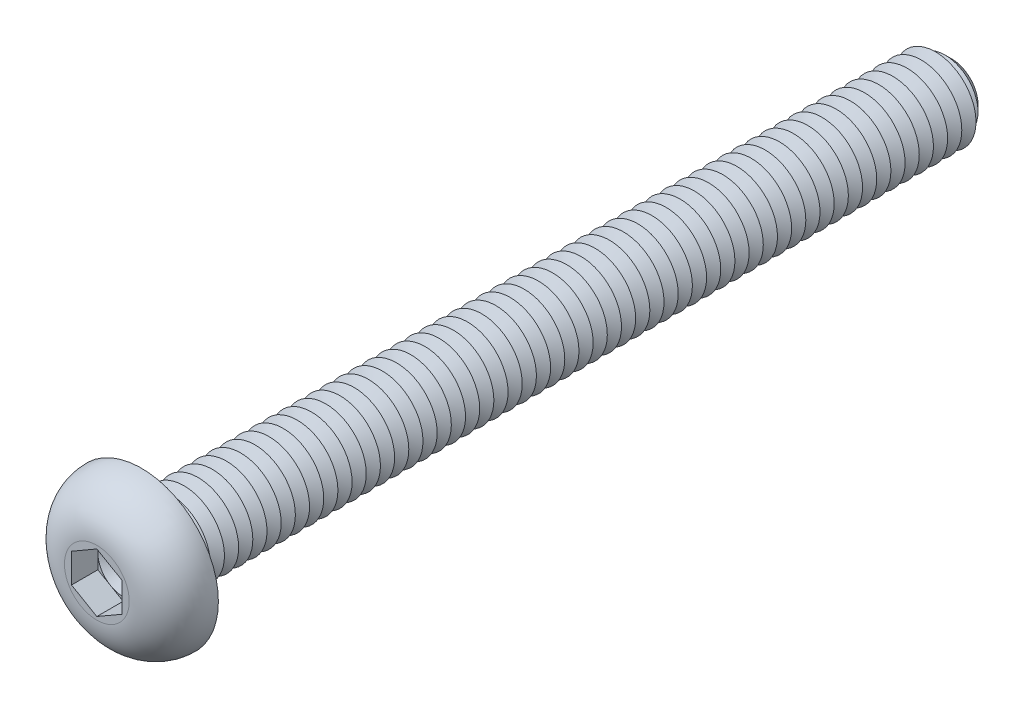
ISO-10303-21;
HEADER;
FILE_DESCRIPTION(('STEP AP214'),'2;1');
FILE_NAME('part.step','',(''),(''),'','','');
FILE_SCHEMA(('AUTOMOTIVE_DESIGN { 1 0 10303 214 1 1 1 1 }'));
ENDSEC;
DATA;
#1=APPLICATION_CONTEXT('core data for automotive mechanical design processes');
#2=APPLICATION_PROTOCOL_DEFINITION('international standard','automotive_design',2000,#1);
#3=PRODUCT_CONTEXT('',#1,'mechanical');
#4=PRODUCT('Part','Part','',(#3));
#5=PRODUCT_RELATED_PRODUCT_CATEGORY('part','',(#4));
#6=PRODUCT_DEFINITION_FORMATION('','',#4);
#7=PRODUCT_DEFINITION_CONTEXT('part definition',#1,'design');
#8=PRODUCT_DEFINITION('design','',#6,#7);
#9=PRODUCT_DEFINITION_SHAPE('','',#8);
#10=(LENGTH_UNIT() NAMED_UNIT(*) SI_UNIT(.MILLI.,.METRE.));
#11=(NAMED_UNIT(*) PLANE_ANGLE_UNIT() SI_UNIT($,.RADIAN.));
#12=(NAMED_UNIT(*) SI_UNIT($,.STERADIAN.) SOLID_ANGLE_UNIT());
#13=UNCERTAINTY_MEASURE_WITH_UNIT(LENGTH_MEASURE(1.E-05),#10,'distance_accuracy_value','');
#14=(GEOMETRIC_REPRESENTATION_CONTEXT(3) GLOBAL_UNCERTAINTY_ASSIGNED_CONTEXT((#13)) GLOBAL_UNIT_ASSIGNED_CONTEXT((#10,
#11,#12)) REPRESENTATION_CONTEXT('',''));
#15=CARTESIAN_POINT('',(0.,0.,0.));
#16=DIRECTION('',(0.,0.,1.));
#17=DIRECTION('',(1.,0.,0.));
#18=AXIS2_PLACEMENT_3D('',#15,#16,#17);
#19=CARTESIAN_POINT('',(0.,0.,0.900000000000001));
#20=DIRECTION('',(0.,0.,1.));
#21=DIRECTION('',(1.,0.,0.));
#22=AXIS2_PLACEMENT_3D('',#19,#20,#21);
#23=PLANE('',#22);
#24=CARTESIAN_POINT('',(0.,0.,0.900000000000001));
#25=DIRECTION('',(0.,0.,1.));
#26=DIRECTION('',(1.,0.,0.));
#27=AXIS2_PLACEMENT_3D('',#24,#25,#26);
#28=CIRCLE('',#27,1.25);
#29=CARTESIAN_POINT('',(1.25,0.,0.900000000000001));
#30=VERTEX_POINT('',#29);
#31=CARTESIAN_POINT('',(0.625,1.08253175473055,0.900000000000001));
#32=VERTEX_POINT('',#31);
#33=EDGE_CURVE('E117',#30,#32,#28,.T.);
#34=ORIENTED_EDGE('',*,*,#33,.F.);
#35=DIRECTION('',(0.,1.,0.));
#36=VECTOR('',#35,1.);
#37=CARTESIAN_POINT('',(1.25,-0.721687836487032,0.900000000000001));
#38=LINE('',#37,#36);
#39=CARTESIAN_POINT('',(1.25,0.721687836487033,0.900000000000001));
#40=VERTEX_POINT('',#39);
#41=EDGE_CURVE('E140',#30,#40,#38,.T.);
#42=ORIENTED_EDGE('',*,*,#41,.T.);
#43=DIRECTION('',(-0.866025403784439,0.5,0.));
#44=VECTOR('',#43,1.);
#45=CARTESIAN_POINT('',(1.25,0.721687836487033,0.900000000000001));
#46=LINE('',#45,#44);
#47=EDGE_CURVE('E135',#40,#32,#46,.T.);
#48=ORIENTED_EDGE('',*,*,#47,.T.);
#49=EDGE_LOOP('',(#34,#42,#48));
#50=FACE_BOUND('',#49,.T.);
#51=ADVANCED_FACE('F39',(#50),#23,.T.);
#52=CARTESIAN_POINT('',(0.,0.,0.900000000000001));
#53=DIRECTION('',(0.,0.,1.));
#54=DIRECTION('',(1.,0.,0.));
#55=AXIS2_PLACEMENT_3D('',#52,#53,#54);
#56=CIRCLE('',#55,1.25);
#57=CARTESIAN_POINT('',(-0.625,1.08253175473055,0.900000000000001));
#58=VERTEX_POINT('',#57);
#59=EDGE_CURVE('E11',#32,#58,#56,.T.);
#60=ORIENTED_EDGE('',*,*,#59,.F.);
#61=CARTESIAN_POINT('',(0.,1.44337567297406,0.900000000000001));
#62=VERTEX_POINT('',#61);
#63=EDGE_CURVE('E130',#32,#62,#46,.T.);
#64=ORIENTED_EDGE('',*,*,#63,.T.);
#65=DIRECTION('',(-0.866025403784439,-0.5,0.));
#66=VECTOR('',#65,1.);
#67=CARTESIAN_POINT('',(0.,1.44337567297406,0.900000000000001));
#68=LINE('',#67,#66);
#69=EDGE_CURVE('E132',#62,#58,#68,.T.);
#70=ORIENTED_EDGE('',*,*,#69,.T.);
#71=EDGE_LOOP('',(#60,#64,#70));
#72=FACE_BOUND('',#71,.T.);
#73=ADVANCED_FACE('F129',(#72),#23,.T.);
#74=CARTESIAN_POINT('',(-1.25,0.,0.900000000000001));
#75=VERTEX_POINT('',#74);
#76=EDGE_CURVE('E49',#58,#75,#56,.T.);
#77=ORIENTED_EDGE('',*,*,#76,.F.);
#78=CARTESIAN_POINT('',(-1.25,0.721687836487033,0.900000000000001));
#79=VERTEX_POINT('',#78);
#80=EDGE_CURVE('E143',#58,#79,#68,.T.);
#81=ORIENTED_EDGE('',*,*,#80,.T.);
#82=DIRECTION('',(0.,-1.,0.));
#83=VECTOR('',#82,1.);
#84=CARTESIAN_POINT('',(-1.25,0.721687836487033,0.900000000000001));
#85=LINE('',#84,#83);
#86=EDGE_CURVE('E154',#79,#75,#85,.T.);
#87=ORIENTED_EDGE('',*,*,#86,.T.);
#88=EDGE_LOOP('',(#77,#81,#87));
#89=FACE_BOUND('',#88,.T.);
#90=ADVANCED_FACE('F259',(#89),#23,.T.);
#91=CARTESIAN_POINT('',(-0.625,-1.08253175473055,0.900000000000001));
#92=VERTEX_POINT('',#91);
#93=EDGE_CURVE('E240',#75,#92,#56,.T.);
#94=ORIENTED_EDGE('',*,*,#93,.F.);
#95=CARTESIAN_POINT('',(-1.25,-0.721687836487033,0.900000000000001));
#96=VERTEX_POINT('',#95);
#97=EDGE_CURVE('E153',#75,#96,#85,.T.);
#98=ORIENTED_EDGE('',*,*,#97,.T.);
#99=DIRECTION('',(0.866025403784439,-0.5,0.));
#100=VECTOR('',#99,1.);
#101=CARTESIAN_POINT('',(-1.25,-0.721687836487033,0.900000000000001));
#102=LINE('',#101,#100);
#103=EDGE_CURVE('E159',#96,#92,#102,.T.);
#104=ORIENTED_EDGE('',*,*,#103,.T.);
#105=EDGE_LOOP('',(#94,#98,#104));
#106=FACE_BOUND('',#105,.T.);
#107=ADVANCED_FACE('F253',(#106),#23,.T.);
#108=CARTESIAN_POINT('',(0.625,-1.08253175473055,0.900000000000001));
#109=VERTEX_POINT('',#108);
#110=EDGE_CURVE('E56',#92,#109,#56,.T.);
#111=ORIENTED_EDGE('',*,*,#110,.F.);
#112=CARTESIAN_POINT('',(0.,-1.44337567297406,0.900000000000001));
#113=VERTEX_POINT('',#112);
#114=EDGE_CURVE('E158',#92,#113,#102,.T.);
#115=ORIENTED_EDGE('',*,*,#114,.T.);
#116=DIRECTION('',(0.866025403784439,0.5,0.));
#117=VECTOR('',#116,1.);
#118=CARTESIAN_POINT('',(0.,-1.44337567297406,0.900000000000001));
#119=LINE('',#118,#117);
#120=EDGE_CURVE('E164',#113,#109,#119,.T.);
#121=ORIENTED_EDGE('',*,*,#120,.T.);
#122=EDGE_LOOP('',(#111,#115,#121));
#123=FACE_BOUND('',#122,.T.);
#124=ADVANCED_FACE('F277',(#123),#23,.T.);
#125=CARTESIAN_POINT('',(0.,0.,-40.));
#126=DIRECTION('',(0.,0.,1.));
#127=DIRECTION('',(1.,0.,0.));
#128=AXIS2_PLACEMENT_3D('',#125,#126,#127);
#129=CYLINDRICAL_SURFACE('',#128,2.);
#130=CARTESIAN_POINT('',(0.,0.,-0.300000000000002));
#131=DIRECTION('',(0.,0.,1.));
#132=DIRECTION('',(1.,0.,0.));
#133=AXIS2_PLACEMENT_3D('',#130,#131,#132);
#134=CIRCLE('',#133,2.);
#135=CARTESIAN_POINT('',(2.,0.,-0.300000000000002));
#136=VERTEX_POINT('',#135);
#137=EDGE_CURVE('E221',#136,#136,#134,.F.);
#138=ORIENTED_EDGE('',*,*,#137,.T.);
#139=EDGE_LOOP('',(#138));
#140=FACE_BOUND('',#139,.T.);
#141=CARTESIAN_POINT('',(0.,0.,-0.699999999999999));
#142=DIRECTION('',(0.,0.,1.));
#143=DIRECTION('',(1.,0.,0.));
#144=AXIS2_PLACEMENT_3D('',#141,#142,#143);
#145=CIRCLE('',#144,2.);
#146=CARTESIAN_POINT('',(2.,0.,-0.699999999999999));
#147=VERTEX_POINT('',#146);
#148=EDGE_CURVE('E149',#147,#147,#145,.T.);
#149=ORIENTED_EDGE('',*,*,#148,.T.);
#150=EDGE_LOOP('',(#149));
#151=FACE_BOUND('',#150,.T.);
#152=ADVANCED_FACE('F733',(#140,#151),#129,.T.);
#153=CARTESIAN_POINT('',(0.,3.8,0.));
#154=DIRECTION('',(0.,0.,1.));
#155=DIRECTION('',(1.,0.,0.));
#156=AXIS2_PLACEMENT_3D('',#153,#154,#155);
#157=PLANE('',#156);
#158=CARTESIAN_POINT('',(0.,0.,0.));
#159=DIRECTION('',(0.,0.,1.));
#160=DIRECTION('',(1.,0.,0.));
#161=AXIS2_PLACEMENT_3D('',#158,#159,#160);
#162=CIRCLE('',#161,2.3);
#163=CARTESIAN_POINT('',(2.3,0.,0.));
#164=VERTEX_POINT('',#163);
#165=EDGE_CURVE('E230',#164,#164,#162,.T.);
#166=ORIENTED_EDGE('',*,*,#165,.T.);
#167=EDGE_LOOP('',(#166));
#168=FACE_BOUND('',#167,.T.);
#169=CARTESIAN_POINT('',(0.,0.,0.));
#170=DIRECTION('',(0.,0.,1.));
#171=DIRECTION('',(1.,0.,0.));
#172=AXIS2_PLACEMENT_3D('',#169,#170,#171);
#173=CIRCLE('',#172,3.8);
#174=CARTESIAN_POINT('',(3.8,0.,0.));
#175=VERTEX_POINT('',#174);
#176=EDGE_CURVE('E195',#175,#175,#173,.T.);
#177=ORIENTED_EDGE('',*,*,#176,.F.);
#178=EDGE_LOOP('',(#177));
#179=FACE_BOUND('',#178,.T.);
#180=ADVANCED_FACE('F738',(#168,#179),#157,.F.);
#181=CARTESIAN_POINT('',(0.,0.,2.2));
#182=DIRECTION('',(0.,0.,-1.));
#183=DIRECTION('',(-1.,0.,0.));
#184=AXIS2_PLACEMENT_3D('',#181,#182,#183);
#185=PLANE('',#184);
#186=DIRECTION('',(-0.866025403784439,-0.5,0.));
#187=VECTOR('',#186,1.);
#188=CARTESIAN_POINT('',(0.,1.44337567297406,2.2));
#189=LINE('',#188,#187);
#190=CARTESIAN_POINT('',(0.,1.44337567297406,2.2));
#191=VERTEX_POINT('',#190);
#192=CARTESIAN_POINT('',(-1.25,0.721687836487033,2.2));
#193=VERTEX_POINT('',#192);
#194=EDGE_CURVE('E173',#191,#193,#189,.T.);
#195=ORIENTED_EDGE('',*,*,#194,.F.);
#196=DIRECTION('',(-0.866025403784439,0.5,0.));
#197=VECTOR('',#196,1.);
#198=CARTESIAN_POINT('',(1.25,0.721687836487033,2.2));
#199=LINE('',#198,#197);
#200=CARTESIAN_POINT('',(1.25,0.721687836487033,2.2));
#201=VERTEX_POINT('',#200);
#202=EDGE_CURVE('E64',#201,#191,#199,.T.);
#203=ORIENTED_EDGE('',*,*,#202,.F.);
#204=DIRECTION('',(0.,1.,0.));
#205=VECTOR('',#204,1.);
#206=CARTESIAN_POINT('',(1.25,-0.721687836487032,2.2));
#207=LINE('',#206,#205);
#208=CARTESIAN_POINT('',(1.25,-0.721687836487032,2.2));
#209=VERTEX_POINT('',#208);
#210=EDGE_CURVE('E138',#209,#201,#207,.T.);
#211=ORIENTED_EDGE('',*,*,#210,.F.);
#212=DIRECTION('',(0.866025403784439,0.5,0.));
#213=VECTOR('',#212,1.);
#214=CARTESIAN_POINT('',(0.,-1.44337567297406,2.2));
#215=LINE('',#214,#213);
#216=CARTESIAN_POINT('',(0.,-1.44337567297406,2.2));
#217=VERTEX_POINT('',#216);
#218=EDGE_CURVE('E185',#217,#209,#215,.T.);
#219=ORIENTED_EDGE('',*,*,#218,.F.);
#220=DIRECTION('',(0.866025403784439,-0.5,0.));
#221=VECTOR('',#220,1.);
#222=CARTESIAN_POINT('',(-1.25,-0.721687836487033,2.2));
#223=LINE('',#222,#221);
#224=CARTESIAN_POINT('',(-1.25,-0.721687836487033,2.2));
#225=VERTEX_POINT('',#224);
#226=EDGE_CURVE('E181',#225,#217,#223,.T.);
#227=ORIENTED_EDGE('',*,*,#226,.F.);
#228=DIRECTION('',(0.,-1.,0.));
#229=VECTOR('',#228,1.);
#230=CARTESIAN_POINT('',(-1.25,0.721687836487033,2.2));
#231=LINE('',#230,#229);
#232=EDGE_CURVE('E177',#193,#225,#231,.T.);
#233=ORIENTED_EDGE('',*,*,#232,.F.);
#234=EDGE_LOOP('',(#195,#203,#211,#219,#227,#233));
#235=FACE_BOUND('',#234,.T.);
#236=CARTESIAN_POINT('',(0.,0.,2.2));
#237=DIRECTION('',(0.,0.,1.));
#238=DIRECTION('',(1.,0.,0.));
#239=AXIS2_PLACEMENT_3D('',#236,#237,#238);
#240=CIRCLE('',#239,1.6);
#241=CARTESIAN_POINT('',(1.6,0.,2.2));
#242=VERTEX_POINT('',#241);
#243=EDGE_CURVE('E213',#242,#242,#240,.T.);
#244=ORIENTED_EDGE('',*,*,#243,.T.);
#245=EDGE_LOOP('',(#244));
#246=FACE_BOUND('',#245,.T.);
#247=ADVANCED_FACE('F268',(#235,#246),#185,.F.);
#248=CARTESIAN_POINT('',(0.,0.,0.));
#249=DIRECTION('',(0.,0.,1.));
#250=DIRECTION('',(1.,0.,0.));
#251=AXIS2_PLACEMENT_3D('',#248,#249,#250);
#252=DEGENERATE_TOROIDAL_SURFACE('',#251,1.6,2.2,.T.);
#253=ORIENTED_EDGE('',*,*,#243,.F.);
#254=EDGE_LOOP('',(#253));
#255=FACE_BOUND('',#254,.T.);
#256=ORIENTED_EDGE('',*,*,#176,.T.);
#257=EDGE_LOOP('',(#256));
#258=FACE_BOUND('',#257,.T.);
#259=ADVANCED_FACE('F1912',(#255,#258),#252,.T.);
#260=CARTESIAN_POINT('',(1.25,0.721687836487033,0.900000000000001));
#261=DIRECTION('',(0.5,0.866025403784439,0.));
#262=DIRECTION('',(-0.866025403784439,0.5,0.));
#263=AXIS2_PLACEMENT_3D('',#260,#261,#262);
#264=PLANE('',#263);
#265=ORIENTED_EDGE('',*,*,#202,.T.);
#266=DIRECTION('',(0.,0.,1.));
#267=VECTOR('',#266,1.);
#268=CARTESIAN_POINT('',(0.,1.44337567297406,0.900000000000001));
#269=LINE('',#268,#267);
#270=EDGE_CURVE('E136',#62,#191,#269,.T.);
#271=ORIENTED_EDGE('',*,*,#270,.F.);
#272=ORIENTED_EDGE('',*,*,#63,.F.);
#273=ORIENTED_EDGE('',*,*,#47,.F.);
#274=DIRECTION('',(0.,0.,1.));
#275=VECTOR('',#274,1.);
#276=CARTESIAN_POINT('',(1.25,0.721687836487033,0.900000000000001));
#277=LINE('',#276,#275);
#278=EDGE_CURVE('E192',#40,#201,#277,.T.);
#279=ORIENTED_EDGE('',*,*,#278,.T.);
#280=EDGE_LOOP('',(#265,#271,#272,#273,#279));
#281=FACE_BOUND('',#280,.T.);
#282=ADVANCED_FACE('F134',(#281),#264,.F.);
#283=CARTESIAN_POINT('',(1.25,-0.721687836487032,0.900000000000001));
#284=DIRECTION('',(1.,0.,0.));
#285=DIRECTION('',(0.,1.,0.));
#286=AXIS2_PLACEMENT_3D('',#283,#284,#285);
#287=PLANE('',#286);
#288=ORIENTED_EDGE('',*,*,#210,.T.);
#289=ORIENTED_EDGE('',*,*,#278,.F.);
#290=ORIENTED_EDGE('',*,*,#41,.F.);
#291=CARTESIAN_POINT('',(1.25,-0.721687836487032,0.900000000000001));
#292=VERTEX_POINT('',#291);
#293=EDGE_CURVE('E168',#292,#30,#38,.T.);
#294=ORIENTED_EDGE('',*,*,#293,.F.);
#295=DIRECTION('',(0.,0.,1.));
#296=VECTOR('',#295,1.);
#297=CARTESIAN_POINT('',(1.25,-0.721687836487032,0.900000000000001));
#298=LINE('',#297,#296);
#299=EDGE_CURVE('E196',#292,#209,#298,.T.);
#300=ORIENTED_EDGE('',*,*,#299,.T.);
#301=EDGE_LOOP('',(#288,#289,#290,#294,#300));
#302=FACE_BOUND('',#301,.T.);
#303=ADVANCED_FACE('F1930',(#302),#287,.F.);
#304=CARTESIAN_POINT('',(0.,-1.44337567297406,0.900000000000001));
#305=DIRECTION('',(0.5,-0.866025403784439,0.));
#306=DIRECTION('',(0.866025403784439,0.5,0.));
#307=AXIS2_PLACEMENT_3D('',#304,#305,#306);
#308=PLANE('',#307);
#309=ORIENTED_EDGE('',*,*,#218,.T.);
#310=ORIENTED_EDGE('',*,*,#299,.F.);
#311=EDGE_CURVE('E163',#109,#292,#119,.T.);
#312=ORIENTED_EDGE('',*,*,#311,.F.);
#313=ORIENTED_EDGE('',*,*,#120,.F.);
#314=DIRECTION('',(0.,0.,1.));
#315=VECTOR('',#314,1.);
#316=CARTESIAN_POINT('',(0.,-1.44337567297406,0.900000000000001));
#317=LINE('',#316,#315);
#318=EDGE_CURVE('E199',#113,#217,#317,.T.);
#319=ORIENTED_EDGE('',*,*,#318,.T.);
#320=EDGE_LOOP('',(#309,#310,#312,#313,#319));
#321=FACE_BOUND('',#320,.T.);
#322=ADVANCED_FACE('F280',(#321),#308,.F.);
#323=CARTESIAN_POINT('',(-1.25,-0.721687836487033,0.900000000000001));
#324=DIRECTION('',(-0.5,-0.866025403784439,0.));
#325=DIRECTION('',(0.866025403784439,-0.5,0.));
#326=AXIS2_PLACEMENT_3D('',#323,#324,#325);
#327=PLANE('',#326);
#328=ORIENTED_EDGE('',*,*,#226,.T.);
#329=ORIENTED_EDGE('',*,*,#318,.F.);
#330=ORIENTED_EDGE('',*,*,#114,.F.);
#331=ORIENTED_EDGE('',*,*,#103,.F.);
#332=DIRECTION('',(0.,0.,1.));
#333=VECTOR('',#332,1.);
#334=CARTESIAN_POINT('',(-1.25,-0.721687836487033,0.900000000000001));
#335=LINE('',#334,#333);
#336=EDGE_CURVE('E202',#96,#225,#335,.T.);
#337=ORIENTED_EDGE('',*,*,#336,.T.);
#338=EDGE_LOOP('',(#328,#329,#330,#331,#337));
#339=FACE_BOUND('',#338,.T.);
#340=ADVANCED_FACE('F273',(#339),#327,.F.);
#341=CARTESIAN_POINT('',(-1.25,0.721687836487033,0.900000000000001));
#342=DIRECTION('',(-1.,0.,0.));
#343=DIRECTION('',(0.,0.,1.));
#344=AXIS2_PLACEMENT_3D('',#341,#342,#343);
#345=PLANE('',#344);
#346=ORIENTED_EDGE('',*,*,#232,.T.);
#347=ORIENTED_EDGE('',*,*,#336,.F.);
#348=ORIENTED_EDGE('',*,*,#97,.F.);
#349=ORIENTED_EDGE('',*,*,#86,.F.);
#350=DIRECTION('',(0.,0.,1.));
#351=VECTOR('',#350,1.);
#352=CARTESIAN_POINT('',(-1.25,0.721687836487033,0.900000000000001));
#353=LINE('',#352,#351);
#354=EDGE_CURVE('E205',#79,#193,#353,.T.);
#355=ORIENTED_EDGE('',*,*,#354,.T.);
#356=EDGE_LOOP('',(#346,#347,#348,#349,#355));
#357=FACE_BOUND('',#356,.T.);
#358=ADVANCED_FACE('F258',(#357),#345,.F.);
#359=CARTESIAN_POINT('',(0.,1.44337567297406,0.900000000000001));
#360=DIRECTION('',(-0.5,0.866025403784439,0.));
#361=DIRECTION('',(-0.866025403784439,-0.5,0.));
#362=AXIS2_PLACEMENT_3D('',#359,#360,#361);
#363=PLANE('',#362);
#364=ORIENTED_EDGE('',*,*,#194,.T.);
#365=ORIENTED_EDGE('',*,*,#354,.F.);
#366=ORIENTED_EDGE('',*,*,#80,.F.);
#367=ORIENTED_EDGE('',*,*,#69,.F.);
#368=ORIENTED_EDGE('',*,*,#270,.T.);
#369=EDGE_LOOP('',(#364,#365,#366,#367,#368));
#370=FACE_BOUND('',#369,.T.);
#371=ADVANCED_FACE('F262',(#370),#363,.F.);
#372=EDGE_CURVE('E43',#109,#30,#56,.T.);
#373=ORIENTED_EDGE('',*,*,#372,.F.);
#374=ORIENTED_EDGE('',*,*,#311,.T.);
#375=ORIENTED_EDGE('',*,*,#293,.T.);
#376=EDGE_LOOP('',(#373,#374,#375));
#377=FACE_BOUND('',#376,.T.);
#378=ADVANCED_FACE('F718',(#377),#23,.T.);
#379=CARTESIAN_POINT('',(0.,0.,-0.699999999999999));
#380=DIRECTION('',(0.,0.,1.));
#381=DIRECTION('',(1.,0.,0.));
#382=AXIS2_PLACEMENT_3D('',#379,#380,#381);
#383=CONICAL_SURFACE('',#382,2.,1.04719755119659);
#384=CARTESIAN_POINT('',(0.,0.,-1.05));
#385=DIRECTION('',(0.,0.,1.));
#386=DIRECTION('',(1.,0.,0.));
#387=AXIS2_PLACEMENT_3D('',#384,#385,#386);
#388=CIRCLE('',#387,1.3937822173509);
#389=CARTESIAN_POINT('',(1.3937822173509,0.,-1.05));
#390=VERTEX_POINT('',#389);
#391=EDGE_CURVE('E323',#390,#390,#388,.T.);
#392=ORIENTED_EDGE('',*,*,#391,.T.);
#393=EDGE_LOOP('',(#392));
#394=FACE_BOUND('',#393,.T.);
#395=ORIENTED_EDGE('',*,*,#148,.F.);
#396=EDGE_LOOP('',(#395));
#397=FACE_BOUND('',#396,.T.);
#398=ADVANCED_FACE('F703',(#394,#397),#383,.T.);
#399=CARTESIAN_POINT('',(0.,0.,-1.05));
#400=DIRECTION('',(0.,0.,-1.));
#401=DIRECTION('',(-1.,0.,0.));
#402=AXIS2_PLACEMENT_3D('',#399,#400,#401);
#403=CONICAL_SURFACE('',#402,1.3937822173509,1.0471975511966);
#404=CARTESIAN_POINT('',(0.,0.,-1.4));
#405=DIRECTION('',(0.,0.,1.));
#406=DIRECTION('',(1.,0.,0.));
#407=AXIS2_PLACEMENT_3D('',#404,#405,#406);
#408=CIRCLE('',#407,2.);
#409=CARTESIAN_POINT('',(2.,0.,-1.4));
#410=VERTEX_POINT('',#409);
#411=EDGE_CURVE('E325',#410,#410,#408,.T.);
#412=ORIENTED_EDGE('',*,*,#411,.T.);
#413=EDGE_LOOP('',(#412));
#414=FACE_BOUND('',#413,.T.);
#415=ORIENTED_EDGE('',*,*,#391,.F.);
#416=EDGE_LOOP('',(#415));
#417=FACE_BOUND('',#416,.T.);
#418=ADVANCED_FACE('F706',(#414,#417),#403,.T.);
#419=CARTESIAN_POINT('',(0.,0.,-1.4));
#420=DIRECTION('',(0.,0.,1.));
#421=DIRECTION('',(1.,0.,0.));
#422=AXIS2_PLACEMENT_3D('',#419,#420,#421);
#423=CONICAL_SURFACE('',#422,2.,1.04719755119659);
#424=CARTESIAN_POINT('',(0.,0.,-1.75));
#425=DIRECTION('',(0.,0.,1.));
#426=DIRECTION('',(1.,0.,0.));
#427=AXIS2_PLACEMENT_3D('',#424,#425,#426);
#428=CIRCLE('',#427,1.3937822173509);
#429=CARTESIAN_POINT('',(1.3937822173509,0.,-1.75));
#430=VERTEX_POINT('',#429);
#431=EDGE_CURVE('E328',#430,#430,#428,.T.);
#432=ORIENTED_EDGE('',*,*,#431,.T.);
#433=EDGE_LOOP('',(#432));
#434=FACE_BOUND('',#433,.T.);
#435=ORIENTED_EDGE('',*,*,#411,.F.);
#436=EDGE_LOOP('',(#435));
#437=FACE_BOUND('',#436,.T.);
#438=ADVANCED_FACE('F708',(#434,#437),#423,.T.);
#439=CARTESIAN_POINT('',(0.,0.,-1.75));
#440=DIRECTION('',(0.,0.,-1.));
#441=DIRECTION('',(-1.,0.,0.));
#442=AXIS2_PLACEMENT_3D('',#439,#440,#441);
#443=CONICAL_SURFACE('',#442,1.3937822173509,1.0471975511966);
#444=CARTESIAN_POINT('',(0.,0.,-2.1));
#445=DIRECTION('',(0.,0.,1.));
#446=DIRECTION('',(1.,0.,0.));
#447=AXIS2_PLACEMENT_3D('',#444,#445,#446);
#448=CIRCLE('',#447,2.);
#449=CARTESIAN_POINT('',(2.,0.,-2.1));
#450=VERTEX_POINT('',#449);
#451=EDGE_CURVE('E694',#450,#450,#448,.T.);
#452=ORIENTED_EDGE('',*,*,#451,.T.);
#453=EDGE_LOOP('',(#452));
#454=FACE_BOUND('',#453,.T.);
#455=ORIENTED_EDGE('',*,*,#431,.F.);
#456=EDGE_LOOP('',(#455));
#457=FACE_BOUND('',#456,.T.);
#458=ADVANCED_FACE('F715',(#454,#457),#443,.T.);
#459=CARTESIAN_POINT('',(0.,0.,-2.1));
#460=DIRECTION('',(0.,0.,1.));
#461=DIRECTION('',(1.,0.,0.));
#462=AXIS2_PLACEMENT_3D('',#459,#460,#461);
#463=CONICAL_SURFACE('',#462,2.,1.04719755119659);
#464=CARTESIAN_POINT('',(0.,0.,-2.45));
#465=DIRECTION('',(0.,0.,1.));
#466=DIRECTION('',(1.,0.,0.));
#467=AXIS2_PLACEMENT_3D('',#464,#465,#466);
#468=CIRCLE('',#467,1.3937822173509);
#469=CARTESIAN_POINT('',(1.3937822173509,0.,-2.45));
#470=VERTEX_POINT('',#469);
#471=EDGE_CURVE('E690',#470,#470,#468,.T.);
#472=ORIENTED_EDGE('',*,*,#471,.T.);
#473=EDGE_LOOP('',(#472));
#474=FACE_BOUND('',#473,.T.);
#475=ORIENTED_EDGE('',*,*,#451,.F.);
#476=EDGE_LOOP('',(#475));
#477=FACE_BOUND('',#476,.T.);
#478=ADVANCED_FACE('F1864',(#474,#477),#463,.T.);
#479=CARTESIAN_POINT('',(0.,0.,-2.45));
#480=DIRECTION('',(0.,0.,-1.));
#481=DIRECTION('',(-1.,0.,0.));
#482=AXIS2_PLACEMENT_3D('',#479,#480,#481);
#483=CONICAL_SURFACE('',#482,1.3937822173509,1.0471975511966);
#484=CARTESIAN_POINT('',(0.,0.,-2.8));
#485=DIRECTION('',(0.,0.,1.));
#486=DIRECTION('',(1.,0.,0.));
#487=AXIS2_PLACEMENT_3D('',#484,#485,#486);
#488=CIRCLE('',#487,2.);
#489=CARTESIAN_POINT('',(2.,0.,-2.8));
#490=VERTEX_POINT('',#489);
#491=EDGE_CURVE('E686',#490,#490,#488,.T.);
#492=ORIENTED_EDGE('',*,*,#491,.T.);
#493=EDGE_LOOP('',(#492));
#494=FACE_BOUND('',#493,.T.);
#495=ORIENTED_EDGE('',*,*,#471,.F.);
#496=EDGE_LOOP('',(#495));
#497=FACE_BOUND('',#496,.T.);
#498=ADVANCED_FACE('F1854',(#494,#497),#483,.T.);
#499=CARTESIAN_POINT('',(0.,0.,-2.8));
#500=DIRECTION('',(0.,0.,1.));
#501=DIRECTION('',(1.,0.,0.));
#502=AXIS2_PLACEMENT_3D('',#499,#500,#501);
#503=CONICAL_SURFACE('',#502,2.,1.04719755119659);
#504=CARTESIAN_POINT('',(0.,0.,-3.15));
#505=DIRECTION('',(0.,0.,1.));
#506=DIRECTION('',(1.,0.,0.));
#507=AXIS2_PLACEMENT_3D('',#504,#505,#506);
#508=CIRCLE('',#507,1.3937822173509);
#509=CARTESIAN_POINT('',(1.3937822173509,0.,-3.15));
#510=VERTEX_POINT('',#509);
#511=EDGE_CURVE('E682',#510,#510,#508,.T.);
#512=ORIENTED_EDGE('',*,*,#511,.T.);
#513=EDGE_LOOP('',(#512));
#514=FACE_BOUND('',#513,.T.);
#515=ORIENTED_EDGE('',*,*,#491,.F.);
#516=EDGE_LOOP('',(#515));
#517=FACE_BOUND('',#516,.T.);
#518=ADVANCED_FACE('F1844',(#514,#517),#503,.T.);
#519=CARTESIAN_POINT('',(0.,0.,-3.15));
#520=DIRECTION('',(0.,0.,-1.));
#521=DIRECTION('',(-1.,0.,0.));
#522=AXIS2_PLACEMENT_3D('',#519,#520,#521);
#523=CONICAL_SURFACE('',#522,1.3937822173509,1.0471975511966);
#524=CARTESIAN_POINT('',(0.,0.,-3.5));
#525=DIRECTION('',(0.,0.,1.));
#526=DIRECTION('',(1.,0.,0.));
#527=AXIS2_PLACEMENT_3D('',#524,#525,#526);
#528=CIRCLE('',#527,2.);
#529=CARTESIAN_POINT('',(2.,0.,-3.5));
#530=VERTEX_POINT('',#529);
#531=EDGE_CURVE('E678',#530,#530,#528,.T.);
#532=ORIENTED_EDGE('',*,*,#531,.T.);
#533=EDGE_LOOP('',(#532));
#534=FACE_BOUND('',#533,.T.);
#535=ORIENTED_EDGE('',*,*,#511,.F.);
#536=EDGE_LOOP('',(#535));
#537=FACE_BOUND('',#536,.T.);
#538=ADVANCED_FACE('F1834',(#534,#537),#523,.T.);
#539=CARTESIAN_POINT('',(0.,0.,-3.5));
#540=DIRECTION('',(0.,0.,1.));
#541=DIRECTION('',(1.,0.,0.));
#542=AXIS2_PLACEMENT_3D('',#539,#540,#541);
#543=CONICAL_SURFACE('',#542,2.,1.04719755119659);
#544=CARTESIAN_POINT('',(0.,0.,-3.85));
#545=DIRECTION('',(0.,0.,1.));
#546=DIRECTION('',(1.,0.,0.));
#547=AXIS2_PLACEMENT_3D('',#544,#545,#546);
#548=CIRCLE('',#547,1.3937822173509);
#549=CARTESIAN_POINT('',(1.3937822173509,0.,-3.85));
#550=VERTEX_POINT('',#549);
#551=EDGE_CURVE('E674',#550,#550,#548,.T.);
#552=ORIENTED_EDGE('',*,*,#551,.T.);
#553=EDGE_LOOP('',(#552));
#554=FACE_BOUND('',#553,.T.);
#555=ORIENTED_EDGE('',*,*,#531,.F.);
#556=EDGE_LOOP('',(#555));
#557=FACE_BOUND('',#556,.T.);
#558=ADVANCED_FACE('F1824',(#554,#557),#543,.T.);
#559=CARTESIAN_POINT('',(0.,0.,-3.85));
#560=DIRECTION('',(0.,0.,-1.));
#561=DIRECTION('',(-1.,0.,0.));
#562=AXIS2_PLACEMENT_3D('',#559,#560,#561);
#563=CONICAL_SURFACE('',#562,1.3937822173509,1.0471975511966);
#564=CARTESIAN_POINT('',(0.,0.,-4.2));
#565=DIRECTION('',(0.,0.,1.));
#566=DIRECTION('',(1.,0.,0.));
#567=AXIS2_PLACEMENT_3D('',#564,#565,#566);
#568=CIRCLE('',#567,2.);
#569=CARTESIAN_POINT('',(2.,0.,-4.2));
#570=VERTEX_POINT('',#569);
#571=EDGE_CURVE('E670',#570,#570,#568,.T.);
#572=ORIENTED_EDGE('',*,*,#571,.T.);
#573=EDGE_LOOP('',(#572));
#574=FACE_BOUND('',#573,.T.);
#575=ORIENTED_EDGE('',*,*,#551,.F.);
#576=EDGE_LOOP('',(#575));
#577=FACE_BOUND('',#576,.T.);
#578=ADVANCED_FACE('F1814',(#574,#577),#563,.T.);
#579=CARTESIAN_POINT('',(0.,0.,-4.2));
#580=DIRECTION('',(0.,0.,1.));
#581=DIRECTION('',(1.,0.,0.));
#582=AXIS2_PLACEMENT_3D('',#579,#580,#581);
#583=CONICAL_SURFACE('',#582,2.,1.04719755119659);
#584=CARTESIAN_POINT('',(0.,0.,-4.55));
#585=DIRECTION('',(0.,0.,1.));
#586=DIRECTION('',(1.,0.,0.));
#587=AXIS2_PLACEMENT_3D('',#584,#585,#586);
#588=CIRCLE('',#587,1.3937822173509);
#589=CARTESIAN_POINT('',(1.3937822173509,0.,-4.55));
#590=VERTEX_POINT('',#589);
#591=EDGE_CURVE('E666',#590,#590,#588,.T.);
#592=ORIENTED_EDGE('',*,*,#591,.T.);
#593=EDGE_LOOP('',(#592));
#594=FACE_BOUND('',#593,.T.);
#595=ORIENTED_EDGE('',*,*,#571,.F.);
#596=EDGE_LOOP('',(#595));
#597=FACE_BOUND('',#596,.T.);
#598=ADVANCED_FACE('F1804',(#594,#597),#583,.T.);
#599=CARTESIAN_POINT('',(0.,0.,-4.55));
#600=DIRECTION('',(0.,0.,-1.));
#601=DIRECTION('',(-1.,0.,0.));
#602=AXIS2_PLACEMENT_3D('',#599,#600,#601);
#603=CONICAL_SURFACE('',#602,1.3937822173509,1.0471975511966);
#604=CARTESIAN_POINT('',(0.,0.,-4.9));
#605=DIRECTION('',(0.,0.,1.));
#606=DIRECTION('',(1.,0.,0.));
#607=AXIS2_PLACEMENT_3D('',#604,#605,#606);
#608=CIRCLE('',#607,2.);
#609=CARTESIAN_POINT('',(2.,0.,-4.9));
#610=VERTEX_POINT('',#609);
#611=EDGE_CURVE('E662',#610,#610,#608,.T.);
#612=ORIENTED_EDGE('',*,*,#611,.T.);
#613=EDGE_LOOP('',(#612));
#614=FACE_BOUND('',#613,.T.);
#615=ORIENTED_EDGE('',*,*,#591,.F.);
#616=EDGE_LOOP('',(#615));
#617=FACE_BOUND('',#616,.T.);
#618=ADVANCED_FACE('F1794',(#614,#617),#603,.T.);
#619=CARTESIAN_POINT('',(0.,0.,-4.9));
#620=DIRECTION('',(0.,0.,1.));
#621=DIRECTION('',(1.,0.,0.));
#622=AXIS2_PLACEMENT_3D('',#619,#620,#621);
#623=CONICAL_SURFACE('',#622,2.,1.04719755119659);
#624=CARTESIAN_POINT('',(0.,0.,-5.25));
#625=DIRECTION('',(0.,0.,1.));
#626=DIRECTION('',(1.,0.,0.));
#627=AXIS2_PLACEMENT_3D('',#624,#625,#626);
#628=CIRCLE('',#627,1.3937822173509);
#629=CARTESIAN_POINT('',(1.3937822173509,0.,-5.25));
#630=VERTEX_POINT('',#629);
#631=EDGE_CURVE('E658',#630,#630,#628,.T.);
#632=ORIENTED_EDGE('',*,*,#631,.T.);
#633=EDGE_LOOP('',(#632));
#634=FACE_BOUND('',#633,.T.);
#635=ORIENTED_EDGE('',*,*,#611,.F.);
#636=EDGE_LOOP('',(#635));
#637=FACE_BOUND('',#636,.T.);
#638=ADVANCED_FACE('F1784',(#634,#637),#623,.T.);
#639=CARTESIAN_POINT('',(0.,0.,-5.25));
#640=DIRECTION('',(0.,0.,-1.));
#641=DIRECTION('',(-1.,0.,0.));
#642=AXIS2_PLACEMENT_3D('',#639,#640,#641);
#643=CONICAL_SURFACE('',#642,1.3937822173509,1.0471975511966);
#644=CARTESIAN_POINT('',(0.,0.,-5.6));
#645=DIRECTION('',(0.,0.,1.));
#646=DIRECTION('',(1.,0.,0.));
#647=AXIS2_PLACEMENT_3D('',#644,#645,#646);
#648=CIRCLE('',#647,2.);
#649=CARTESIAN_POINT('',(2.,0.,-5.6));
#650=VERTEX_POINT('',#649);
#651=EDGE_CURVE('E654',#650,#650,#648,.T.);
#652=ORIENTED_EDGE('',*,*,#651,.T.);
#653=EDGE_LOOP('',(#652));
#654=FACE_BOUND('',#653,.T.);
#655=ORIENTED_EDGE('',*,*,#631,.F.);
#656=EDGE_LOOP('',(#655));
#657=FACE_BOUND('',#656,.T.);
#658=ADVANCED_FACE('F1774',(#654,#657),#643,.T.);
#659=CARTESIAN_POINT('',(0.,0.,-5.6));
#660=DIRECTION('',(0.,0.,1.));
#661=DIRECTION('',(1.,0.,0.));
#662=AXIS2_PLACEMENT_3D('',#659,#660,#661);
#663=CONICAL_SURFACE('',#662,2.,1.04719755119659);
#664=CARTESIAN_POINT('',(0.,0.,-5.95));
#665=DIRECTION('',(0.,0.,1.));
#666=DIRECTION('',(1.,0.,0.));
#667=AXIS2_PLACEMENT_3D('',#664,#665,#666);
#668=CIRCLE('',#667,1.3937822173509);
#669=CARTESIAN_POINT('',(1.3937822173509,0.,-5.95));
#670=VERTEX_POINT('',#669);
#671=EDGE_CURVE('E650',#670,#670,#668,.T.);
#672=ORIENTED_EDGE('',*,*,#671,.T.);
#673=EDGE_LOOP('',(#672));
#674=FACE_BOUND('',#673,.T.);
#675=ORIENTED_EDGE('',*,*,#651,.F.);
#676=EDGE_LOOP('',(#675));
#677=FACE_BOUND('',#676,.T.);
#678=ADVANCED_FACE('F1764',(#674,#677),#663,.T.);
#679=CARTESIAN_POINT('',(0.,0.,-5.95));
#680=DIRECTION('',(0.,0.,-1.));
#681=DIRECTION('',(-1.,0.,0.));
#682=AXIS2_PLACEMENT_3D('',#679,#680,#681);
#683=CONICAL_SURFACE('',#682,1.3937822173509,1.0471975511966);
#684=CARTESIAN_POINT('',(0.,0.,-6.3));
#685=DIRECTION('',(0.,0.,1.));
#686=DIRECTION('',(1.,0.,0.));
#687=AXIS2_PLACEMENT_3D('',#684,#685,#686);
#688=CIRCLE('',#687,2.);
#689=CARTESIAN_POINT('',(2.,0.,-6.3));
#690=VERTEX_POINT('',#689);
#691=EDGE_CURVE('E646',#690,#690,#688,.T.);
#692=ORIENTED_EDGE('',*,*,#691,.T.);
#693=EDGE_LOOP('',(#692));
#694=FACE_BOUND('',#693,.T.);
#695=ORIENTED_EDGE('',*,*,#671,.F.);
#696=EDGE_LOOP('',(#695));
#697=FACE_BOUND('',#696,.T.);
#698=ADVANCED_FACE('F1754',(#694,#697),#683,.T.);
#699=CARTESIAN_POINT('',(0.,0.,-6.3));
#700=DIRECTION('',(0.,0.,1.));
#701=DIRECTION('',(1.,0.,0.));
#702=AXIS2_PLACEMENT_3D('',#699,#700,#701);
#703=CONICAL_SURFACE('',#702,2.,1.04719755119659);
#704=CARTESIAN_POINT('',(0.,0.,-6.65));
#705=DIRECTION('',(0.,0.,1.));
#706=DIRECTION('',(1.,0.,0.));
#707=AXIS2_PLACEMENT_3D('',#704,#705,#706);
#708=CIRCLE('',#707,1.3937822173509);
#709=CARTESIAN_POINT('',(1.3937822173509,0.,-6.65));
#710=VERTEX_POINT('',#709);
#711=EDGE_CURVE('E642',#710,#710,#708,.T.);
#712=ORIENTED_EDGE('',*,*,#711,.T.);
#713=EDGE_LOOP('',(#712));
#714=FACE_BOUND('',#713,.T.);
#715=ORIENTED_EDGE('',*,*,#691,.F.);
#716=EDGE_LOOP('',(#715));
#717=FACE_BOUND('',#716,.T.);
#718=ADVANCED_FACE('F1744',(#714,#717),#703,.T.);
#719=CARTESIAN_POINT('',(0.,0.,-6.65));
#720=DIRECTION('',(0.,0.,-1.));
#721=DIRECTION('',(-1.,0.,0.));
#722=AXIS2_PLACEMENT_3D('',#719,#720,#721);
#723=CONICAL_SURFACE('',#722,1.3937822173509,1.0471975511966);
#724=CARTESIAN_POINT('',(0.,0.,-7.));
#725=DIRECTION('',(0.,0.,1.));
#726=DIRECTION('',(1.,0.,0.));
#727=AXIS2_PLACEMENT_3D('',#724,#725,#726);
#728=CIRCLE('',#727,2.);
#729=CARTESIAN_POINT('',(2.,0.,-7.));
#730=VERTEX_POINT('',#729);
#731=EDGE_CURVE('E638',#730,#730,#728,.T.);
#732=ORIENTED_EDGE('',*,*,#731,.T.);
#733=EDGE_LOOP('',(#732));
#734=FACE_BOUND('',#733,.T.);
#735=ORIENTED_EDGE('',*,*,#711,.F.);
#736=EDGE_LOOP('',(#735));
#737=FACE_BOUND('',#736,.T.);
#738=ADVANCED_FACE('F1734',(#734,#737),#723,.T.);
#739=CARTESIAN_POINT('',(0.,0.,-7.));
#740=DIRECTION('',(0.,0.,1.));
#741=DIRECTION('',(1.,0.,0.));
#742=AXIS2_PLACEMENT_3D('',#739,#740,#741);
#743=CONICAL_SURFACE('',#742,2.,1.04719755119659);
#744=CARTESIAN_POINT('',(0.,0.,-7.35));
#745=DIRECTION('',(0.,0.,1.));
#746=DIRECTION('',(1.,0.,0.));
#747=AXIS2_PLACEMENT_3D('',#744,#745,#746);
#748=CIRCLE('',#747,1.3937822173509);
#749=CARTESIAN_POINT('',(1.3937822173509,0.,-7.35));
#750=VERTEX_POINT('',#749);
#751=EDGE_CURVE('E634',#750,#750,#748,.T.);
#752=ORIENTED_EDGE('',*,*,#751,.T.);
#753=EDGE_LOOP('',(#752));
#754=FACE_BOUND('',#753,.T.);
#755=ORIENTED_EDGE('',*,*,#731,.F.);
#756=EDGE_LOOP('',(#755));
#757=FACE_BOUND('',#756,.T.);
#758=ADVANCED_FACE('F1724',(#754,#757),#743,.T.);
#759=CARTESIAN_POINT('',(0.,0.,-7.35));
#760=DIRECTION('',(0.,0.,-1.));
#761=DIRECTION('',(-1.,0.,0.));
#762=AXIS2_PLACEMENT_3D('',#759,#760,#761);
#763=CONICAL_SURFACE('',#762,1.3937822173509,1.0471975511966);
#764=CARTESIAN_POINT('',(0.,0.,-7.7));
#765=DIRECTION('',(0.,0.,1.));
#766=DIRECTION('',(1.,0.,0.));
#767=AXIS2_PLACEMENT_3D('',#764,#765,#766);
#768=CIRCLE('',#767,2.);
#769=CARTESIAN_POINT('',(2.,0.,-7.7));
#770=VERTEX_POINT('',#769);
#771=EDGE_CURVE('E630',#770,#770,#768,.T.);
#772=ORIENTED_EDGE('',*,*,#771,.T.);
#773=EDGE_LOOP('',(#772));
#774=FACE_BOUND('',#773,.T.);
#775=ORIENTED_EDGE('',*,*,#751,.F.);
#776=EDGE_LOOP('',(#775));
#777=FACE_BOUND('',#776,.T.);
#778=ADVANCED_FACE('F1714',(#774,#777),#763,.T.);
#779=CARTESIAN_POINT('',(0.,0.,-7.7));
#780=DIRECTION('',(0.,0.,1.));
#781=DIRECTION('',(1.,0.,0.));
#782=AXIS2_PLACEMENT_3D('',#779,#780,#781);
#783=CONICAL_SURFACE('',#782,2.,1.04719755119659);
#784=CARTESIAN_POINT('',(0.,0.,-8.05));
#785=DIRECTION('',(0.,0.,1.));
#786=DIRECTION('',(1.,0.,0.));
#787=AXIS2_PLACEMENT_3D('',#784,#785,#786);
#788=CIRCLE('',#787,1.3937822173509);
#789=CARTESIAN_POINT('',(1.3937822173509,0.,-8.05));
#790=VERTEX_POINT('',#789);
#791=EDGE_CURVE('E332',#790,#790,#788,.T.);
#792=ORIENTED_EDGE('',*,*,#791,.T.);
#793=EDGE_LOOP('',(#792));
#794=FACE_BOUND('',#793,.T.);
#795=ORIENTED_EDGE('',*,*,#771,.F.);
#796=EDGE_LOOP('',(#795));
#797=FACE_BOUND('',#796,.T.);
#798=ADVANCED_FACE('F1704',(#794,#797),#783,.T.);
#799=CARTESIAN_POINT('',(0.,0.,-8.05));
#800=DIRECTION('',(0.,0.,-1.));
#801=DIRECTION('',(-1.,0.,0.));
#802=AXIS2_PLACEMENT_3D('',#799,#800,#801);
#803=CONICAL_SURFACE('',#802,1.3937822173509,1.0471975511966);
#804=CARTESIAN_POINT('',(0.,0.,-8.4));
#805=DIRECTION('',(0.,0.,1.));
#806=DIRECTION('',(1.,0.,0.));
#807=AXIS2_PLACEMENT_3D('',#804,#805,#806);
#808=CIRCLE('',#807,2.);
#809=CARTESIAN_POINT('',(2.,0.,-8.4));
#810=VERTEX_POINT('',#809);
#811=EDGE_CURVE('E289',#810,#810,#808,.T.);
#812=ORIENTED_EDGE('',*,*,#811,.T.);
#813=EDGE_LOOP('',(#812));
#814=FACE_BOUND('',#813,.T.);
#815=ORIENTED_EDGE('',*,*,#791,.F.);
#816=EDGE_LOOP('',(#815));
#817=FACE_BOUND('',#816,.T.);
#818=ADVANCED_FACE('F1694',(#814,#817),#803,.T.);
#819=CARTESIAN_POINT('',(0.,0.,-8.4));
#820=DIRECTION('',(0.,0.,1.));
#821=DIRECTION('',(1.,0.,0.));
#822=AXIS2_PLACEMENT_3D('',#819,#820,#821);
#823=CONICAL_SURFACE('',#822,2.,1.04719755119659);
#824=CARTESIAN_POINT('',(0.,0.,-8.75));
#825=DIRECTION('',(0.,0.,1.));
#826=DIRECTION('',(1.,0.,0.));
#827=AXIS2_PLACEMENT_3D('',#824,#825,#826);
#828=CIRCLE('',#827,1.3937822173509);
#829=CARTESIAN_POINT('',(1.3937822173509,0.,-8.75));
#830=VERTEX_POINT('',#829);
#831=EDGE_CURVE('E286',#830,#830,#828,.T.);
#832=ORIENTED_EDGE('',*,*,#831,.T.);
#833=EDGE_LOOP('',(#832));
#834=FACE_BOUND('',#833,.T.);
#835=ORIENTED_EDGE('',*,*,#811,.F.);
#836=EDGE_LOOP('',(#835));
#837=FACE_BOUND('',#836,.T.);
#838=ADVANCED_FACE('F1684',(#834,#837),#823,.T.);
#839=CARTESIAN_POINT('',(0.,0.,-8.75));
#840=DIRECTION('',(0.,0.,-1.));
#841=DIRECTION('',(-1.,0.,0.));
#842=AXIS2_PLACEMENT_3D('',#839,#840,#841);
#843=CONICAL_SURFACE('',#842,1.3937822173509,1.0471975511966);
#844=CARTESIAN_POINT('',(0.,0.,-9.1));
#845=DIRECTION('',(0.,0.,1.));
#846=DIRECTION('',(1.,0.,0.));
#847=AXIS2_PLACEMENT_3D('',#844,#845,#846);
#848=CIRCLE('',#847,2.);
#849=CARTESIAN_POINT('',(2.,0.,-9.1));
#850=VERTEX_POINT('',#849);
#851=EDGE_CURVE('E290',#850,#850,#848,.T.);
#852=ORIENTED_EDGE('',*,*,#851,.T.);
#853=EDGE_LOOP('',(#852));
#854=FACE_BOUND('',#853,.T.);
#855=ORIENTED_EDGE('',*,*,#831,.F.);
#856=EDGE_LOOP('',(#855));
#857=FACE_BOUND('',#856,.T.);
#858=ADVANCED_FACE('F1674',(#854,#857),#843,.T.);
#859=CARTESIAN_POINT('',(0.,0.,-9.1));
#860=DIRECTION('',(0.,0.,1.));
#861=DIRECTION('',(1.,0.,0.));
#862=AXIS2_PLACEMENT_3D('',#859,#860,#861);
#863=CONICAL_SURFACE('',#862,2.,1.04719755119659);
#864=CARTESIAN_POINT('',(0.,0.,-9.45));
#865=DIRECTION('',(0.,0.,1.));
#866=DIRECTION('',(1.,0.,0.));
#867=AXIS2_PLACEMENT_3D('',#864,#865,#866);
#868=CIRCLE('',#867,1.3937822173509);
#869=CARTESIAN_POINT('',(1.3937822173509,0.,-9.45));
#870=VERTEX_POINT('',#869);
#871=EDGE_CURVE('E621',#870,#870,#868,.T.);
#872=ORIENTED_EDGE('',*,*,#871,.T.);
#873=EDGE_LOOP('',(#872));
#874=FACE_BOUND('',#873,.T.);
#875=ORIENTED_EDGE('',*,*,#851,.F.);
#876=EDGE_LOOP('',(#875));
#877=FACE_BOUND('',#876,.T.);
#878=ADVANCED_FACE('F1664',(#874,#877),#863,.T.);
#879=CARTESIAN_POINT('',(0.,0.,-9.45));
#880=DIRECTION('',(0.,0.,-1.));
#881=DIRECTION('',(-1.,0.,0.));
#882=AXIS2_PLACEMENT_3D('',#879,#880,#881);
#883=CONICAL_SURFACE('',#882,1.3937822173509,1.0471975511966);
#884=CARTESIAN_POINT('',(0.,0.,-9.8));
#885=DIRECTION('',(0.,0.,1.));
#886=DIRECTION('',(1.,0.,0.));
#887=AXIS2_PLACEMENT_3D('',#884,#885,#886);
#888=CIRCLE('',#887,2.);
#889=CARTESIAN_POINT('',(2.,0.,-9.8));
#890=VERTEX_POINT('',#889);
#891=EDGE_CURVE('E617',#890,#890,#888,.T.);
#892=ORIENTED_EDGE('',*,*,#891,.T.);
#893=EDGE_LOOP('',(#892));
#894=FACE_BOUND('',#893,.T.);
#895=ORIENTED_EDGE('',*,*,#871,.F.);
#896=EDGE_LOOP('',(#895));
#897=FACE_BOUND('',#896,.T.);
#898=ADVANCED_FACE('F1654',(#894,#897),#883,.T.);
#899=CARTESIAN_POINT('',(0.,0.,-9.8));
#900=DIRECTION('',(0.,0.,1.));
#901=DIRECTION('',(1.,0.,0.));
#902=AXIS2_PLACEMENT_3D('',#899,#900,#901);
#903=CONICAL_SURFACE('',#902,2.,1.04719755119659);
#904=CARTESIAN_POINT('',(0.,0.,-10.15));
#905=DIRECTION('',(0.,0.,1.));
#906=DIRECTION('',(1.,0.,0.));
#907=AXIS2_PLACEMENT_3D('',#904,#905,#906);
#908=CIRCLE('',#907,1.3937822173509);
#909=CARTESIAN_POINT('',(1.3937822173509,0.,-10.15));
#910=VERTEX_POINT('',#909);
#911=EDGE_CURVE('E613',#910,#910,#908,.T.);
#912=ORIENTED_EDGE('',*,*,#911,.T.);
#913=EDGE_LOOP('',(#912));
#914=FACE_BOUND('',#913,.T.);
#915=ORIENTED_EDGE('',*,*,#891,.F.);
#916=EDGE_LOOP('',(#915));
#917=FACE_BOUND('',#916,.T.);
#918=ADVANCED_FACE('F1644',(#914,#917),#903,.T.);
#919=CARTESIAN_POINT('',(0.,0.,-10.15));
#920=DIRECTION('',(0.,0.,-1.));
#921=DIRECTION('',(-1.,0.,0.));
#922=AXIS2_PLACEMENT_3D('',#919,#920,#921);
#923=CONICAL_SURFACE('',#922,1.3937822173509,1.0471975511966);
#924=CARTESIAN_POINT('',(0.,0.,-10.5));
#925=DIRECTION('',(0.,0.,1.));
#926=DIRECTION('',(1.,0.,0.));
#927=AXIS2_PLACEMENT_3D('',#924,#925,#926);
#928=CIRCLE('',#927,2.);
#929=CARTESIAN_POINT('',(2.,0.,-10.5));
#930=VERTEX_POINT('',#929);
#931=EDGE_CURVE('E609',#930,#930,#928,.T.);
#932=ORIENTED_EDGE('',*,*,#931,.T.);
#933=EDGE_LOOP('',(#932));
#934=FACE_BOUND('',#933,.T.);
#935=ORIENTED_EDGE('',*,*,#911,.F.);
#936=EDGE_LOOP('',(#935));
#937=FACE_BOUND('',#936,.T.);
#938=ADVANCED_FACE('F1634',(#934,#937),#923,.T.);
#939=CARTESIAN_POINT('',(0.,0.,-10.5));
#940=DIRECTION('',(0.,0.,1.));
#941=DIRECTION('',(1.,0.,0.));
#942=AXIS2_PLACEMENT_3D('',#939,#940,#941);
#943=CONICAL_SURFACE('',#942,2.,1.04719755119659);
#944=CARTESIAN_POINT('',(0.,0.,-10.85));
#945=DIRECTION('',(0.,0.,1.));
#946=DIRECTION('',(1.,0.,0.));
#947=AXIS2_PLACEMENT_3D('',#944,#945,#946);
#948=CIRCLE('',#947,1.3937822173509);
#949=CARTESIAN_POINT('',(1.3937822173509,0.,-10.85));
#950=VERTEX_POINT('',#949);
#951=EDGE_CURVE('E605',#950,#950,#948,.T.);
#952=ORIENTED_EDGE('',*,*,#951,.T.);
#953=EDGE_LOOP('',(#952));
#954=FACE_BOUND('',#953,.T.);
#955=ORIENTED_EDGE('',*,*,#931,.F.);
#956=EDGE_LOOP('',(#955));
#957=FACE_BOUND('',#956,.T.);
#958=ADVANCED_FACE('F1624',(#954,#957),#943,.T.);
#959=CARTESIAN_POINT('',(0.,0.,-10.85));
#960=DIRECTION('',(0.,0.,-1.));
#961=DIRECTION('',(-1.,0.,0.));
#962=AXIS2_PLACEMENT_3D('',#959,#960,#961);
#963=CONICAL_SURFACE('',#962,1.3937822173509,1.0471975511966);
#964=CARTESIAN_POINT('',(0.,0.,-11.2));
#965=DIRECTION('',(0.,0.,1.));
#966=DIRECTION('',(1.,0.,0.));
#967=AXIS2_PLACEMENT_3D('',#964,#965,#966);
#968=CIRCLE('',#967,2.);
#969=CARTESIAN_POINT('',(2.,0.,-11.2));
#970=VERTEX_POINT('',#969);
#971=EDGE_CURVE('E601',#970,#970,#968,.T.);
#972=ORIENTED_EDGE('',*,*,#971,.T.);
#973=EDGE_LOOP('',(#972));
#974=FACE_BOUND('',#973,.T.);
#975=ORIENTED_EDGE('',*,*,#951,.F.);
#976=EDGE_LOOP('',(#975));
#977=FACE_BOUND('',#976,.T.);
#978=ADVANCED_FACE('F1614',(#974,#977),#963,.T.);
#979=CARTESIAN_POINT('',(0.,0.,-11.2));
#980=DIRECTION('',(0.,0.,1.));
#981=DIRECTION('',(1.,0.,0.));
#982=AXIS2_PLACEMENT_3D('',#979,#980,#981);
#983=CONICAL_SURFACE('',#982,2.,1.04719755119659);
#984=CARTESIAN_POINT('',(0.,0.,-11.55));
#985=DIRECTION('',(0.,0.,1.));
#986=DIRECTION('',(1.,0.,0.));
#987=AXIS2_PLACEMENT_3D('',#984,#985,#986);
#988=CIRCLE('',#987,1.3937822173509);
#989=CARTESIAN_POINT('',(1.3937822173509,0.,-11.55));
#990=VERTEX_POINT('',#989);
#991=EDGE_CURVE('E597',#990,#990,#988,.T.);
#992=ORIENTED_EDGE('',*,*,#991,.T.);
#993=EDGE_LOOP('',(#992));
#994=FACE_BOUND('',#993,.T.);
#995=ORIENTED_EDGE('',*,*,#971,.F.);
#996=EDGE_LOOP('',(#995));
#997=FACE_BOUND('',#996,.T.);
#998=ADVANCED_FACE('F1604',(#994,#997),#983,.T.);
#999=CARTESIAN_POINT('',(0.,0.,-11.55));
#1000=DIRECTION('',(0.,0.,-1.));
#1001=DIRECTION('',(-1.,0.,0.));
#1002=AXIS2_PLACEMENT_3D('',#999,#1000,#1001);
#1003=CONICAL_SURFACE('',#1002,1.3937822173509,1.0471975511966);
#1004=CARTESIAN_POINT('',(0.,0.,-11.9));
#1005=DIRECTION('',(0.,0.,1.));
#1006=DIRECTION('',(1.,0.,0.));
#1007=AXIS2_PLACEMENT_3D('',#1004,#1005,#1006);
#1008=CIRCLE('',#1007,2.);
#1009=CARTESIAN_POINT('',(2.,0.,-11.9));
#1010=VERTEX_POINT('',#1009);
#1011=EDGE_CURVE('E593',#1010,#1010,#1008,.T.);
#1012=ORIENTED_EDGE('',*,*,#1011,.T.);
#1013=EDGE_LOOP('',(#1012));
#1014=FACE_BOUND('',#1013,.T.);
#1015=ORIENTED_EDGE('',*,*,#991,.F.);
#1016=EDGE_LOOP('',(#1015));
#1017=FACE_BOUND('',#1016,.T.);
#1018=ADVANCED_FACE('F1594',(#1014,#1017),#1003,.T.);
#1019=CARTESIAN_POINT('',(0.,0.,-11.9));
#1020=DIRECTION('',(0.,0.,1.));
#1021=DIRECTION('',(1.,0.,0.));
#1022=AXIS2_PLACEMENT_3D('',#1019,#1020,#1021);
#1023=CONICAL_SURFACE('',#1022,2.,1.04719755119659);
#1024=CARTESIAN_POINT('',(0.,0.,-12.25));
#1025=DIRECTION('',(0.,0.,1.));
#1026=DIRECTION('',(1.,0.,0.));
#1027=AXIS2_PLACEMENT_3D('',#1024,#1025,#1026);
#1028=CIRCLE('',#1027,1.3937822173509);
#1029=CARTESIAN_POINT('',(1.3937822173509,0.,-12.25));
#1030=VERTEX_POINT('',#1029);
#1031=EDGE_CURVE('E589',#1030,#1030,#1028,.T.);
#1032=ORIENTED_EDGE('',*,*,#1031,.T.);
#1033=EDGE_LOOP('',(#1032));
#1034=FACE_BOUND('',#1033,.T.);
#1035=ORIENTED_EDGE('',*,*,#1011,.F.);
#1036=EDGE_LOOP('',(#1035));
#1037=FACE_BOUND('',#1036,.T.);
#1038=ADVANCED_FACE('F1584',(#1034,#1037),#1023,.T.);
#1039=CARTESIAN_POINT('',(0.,0.,-12.25));
#1040=DIRECTION('',(0.,0.,-1.));
#1041=DIRECTION('',(-1.,0.,0.));
#1042=AXIS2_PLACEMENT_3D('',#1039,#1040,#1041);
#1043=CONICAL_SURFACE('',#1042,1.3937822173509,1.0471975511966);
#1044=CARTESIAN_POINT('',(0.,0.,-12.6));
#1045=DIRECTION('',(0.,0.,1.));
#1046=DIRECTION('',(1.,0.,0.));
#1047=AXIS2_PLACEMENT_3D('',#1044,#1045,#1046);
#1048=CIRCLE('',#1047,2.);
#1049=CARTESIAN_POINT('',(2.,0.,-12.6));
#1050=VERTEX_POINT('',#1049);
#1051=EDGE_CURVE('E585',#1050,#1050,#1048,.T.);
#1052=ORIENTED_EDGE('',*,*,#1051,.T.);
#1053=EDGE_LOOP('',(#1052));
#1054=FACE_BOUND('',#1053,.T.);
#1055=ORIENTED_EDGE('',*,*,#1031,.F.);
#1056=EDGE_LOOP('',(#1055));
#1057=FACE_BOUND('',#1056,.T.);
#1058=ADVANCED_FACE('F1574',(#1054,#1057),#1043,.T.);
#1059=CARTESIAN_POINT('',(0.,0.,-12.6));
#1060=DIRECTION('',(0.,0.,1.));
#1061=DIRECTION('',(1.,0.,0.));
#1062=AXIS2_PLACEMENT_3D('',#1059,#1060,#1061);
#1063=CONICAL_SURFACE('',#1062,2.,1.04719755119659);
#1064=CARTESIAN_POINT('',(0.,0.,-12.95));
#1065=DIRECTION('',(0.,0.,1.));
#1066=DIRECTION('',(1.,0.,0.));
#1067=AXIS2_PLACEMENT_3D('',#1064,#1065,#1066);
#1068=CIRCLE('',#1067,1.3937822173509);
#1069=CARTESIAN_POINT('',(1.3937822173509,0.,-12.95));
#1070=VERTEX_POINT('',#1069);
#1071=EDGE_CURVE('E337',#1070,#1070,#1068,.T.);
#1072=ORIENTED_EDGE('',*,*,#1071,.T.);
#1073=EDGE_LOOP('',(#1072));
#1074=FACE_BOUND('',#1073,.T.);
#1075=ORIENTED_EDGE('',*,*,#1051,.F.);
#1076=EDGE_LOOP('',(#1075));
#1077=FACE_BOUND('',#1076,.T.);
#1078=ADVANCED_FACE('F1564',(#1074,#1077),#1063,.T.);
#1079=CARTESIAN_POINT('',(0.,0.,-12.95));
#1080=DIRECTION('',(0.,0.,-1.));
#1081=DIRECTION('',(-1.,0.,0.));
#1082=AXIS2_PLACEMENT_3D('',#1079,#1080,#1081);
#1083=CONICAL_SURFACE('',#1082,1.3937822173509,1.0471975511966);
#1084=CARTESIAN_POINT('',(0.,0.,-13.3));
#1085=DIRECTION('',(0.,0.,1.));
#1086=DIRECTION('',(1.,0.,0.));
#1087=AXIS2_PLACEMENT_3D('',#1084,#1085,#1086);
#1088=CIRCLE('',#1087,2.);
#1089=CARTESIAN_POINT('',(2.,0.,-13.3));
#1090=VERTEX_POINT('',#1089);
#1091=EDGE_CURVE('E334',#1090,#1090,#1088,.T.);
#1092=ORIENTED_EDGE('',*,*,#1091,.T.);
#1093=EDGE_LOOP('',(#1092));
#1094=FACE_BOUND('',#1093,.T.);
#1095=ORIENTED_EDGE('',*,*,#1071,.F.);
#1096=EDGE_LOOP('',(#1095));
#1097=FACE_BOUND('',#1096,.T.);
#1098=ADVANCED_FACE('F1554',(#1094,#1097),#1083,.T.);
#1099=CARTESIAN_POINT('',(0.,0.,-13.3));
#1100=DIRECTION('',(0.,0.,1.));
#1101=DIRECTION('',(1.,0.,0.));
#1102=AXIS2_PLACEMENT_3D('',#1099,#1100,#1101);
#1103=CONICAL_SURFACE('',#1102,2.,1.04719755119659);
#1104=CARTESIAN_POINT('',(0.,0.,-13.65));
#1105=DIRECTION('',(0.,0.,1.));
#1106=DIRECTION('',(1.,0.,0.));
#1107=AXIS2_PLACEMENT_3D('',#1104,#1105,#1106);
#1108=CIRCLE('',#1107,1.3937822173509);
#1109=CARTESIAN_POINT('',(1.3937822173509,0.,-13.65));
#1110=VERTEX_POINT('',#1109);
#1111=EDGE_CURVE('E338',#1110,#1110,#1108,.T.);
#1112=ORIENTED_EDGE('',*,*,#1111,.T.);
#1113=EDGE_LOOP('',(#1112));
#1114=FACE_BOUND('',#1113,.T.);
#1115=ORIENTED_EDGE('',*,*,#1091,.F.);
#1116=EDGE_LOOP('',(#1115));
#1117=FACE_BOUND('',#1116,.T.);
#1118=ADVANCED_FACE('F1544',(#1114,#1117),#1103,.T.);
#1119=CARTESIAN_POINT('',(0.,0.,-13.65));
#1120=DIRECTION('',(0.,0.,-1.));
#1121=DIRECTION('',(-1.,0.,0.));
#1122=AXIS2_PLACEMENT_3D('',#1119,#1120,#1121);
#1123=CONICAL_SURFACE('',#1122,1.3937822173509,1.0471975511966);
#1124=CARTESIAN_POINT('',(0.,0.,-14.));
#1125=DIRECTION('',(0.,0.,1.));
#1126=DIRECTION('',(1.,0.,0.));
#1127=AXIS2_PLACEMENT_3D('',#1124,#1125,#1126);
#1128=CIRCLE('',#1127,2.);
#1129=CARTESIAN_POINT('',(2.,0.,-14.));
#1130=VERTEX_POINT('',#1129);
#1131=EDGE_CURVE('E575',#1130,#1130,#1128,.T.);
#1132=ORIENTED_EDGE('',*,*,#1131,.T.);
#1133=EDGE_LOOP('',(#1132));
#1134=FACE_BOUND('',#1133,.T.);
#1135=ORIENTED_EDGE('',*,*,#1111,.F.);
#1136=EDGE_LOOP('',(#1135));
#1137=FACE_BOUND('',#1136,.T.);
#1138=ADVANCED_FACE('F1534',(#1134,#1137),#1123,.T.);
#1139=CARTESIAN_POINT('',(0.,0.,-14.));
#1140=DIRECTION('',(0.,0.,1.));
#1141=DIRECTION('',(1.,0.,0.));
#1142=AXIS2_PLACEMENT_3D('',#1139,#1140,#1141);
#1143=CONICAL_SURFACE('',#1142,2.,1.04719755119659);
#1144=CARTESIAN_POINT('',(0.,0.,-14.35));
#1145=DIRECTION('',(0.,0.,1.));
#1146=DIRECTION('',(1.,0.,0.));
#1147=AXIS2_PLACEMENT_3D('',#1144,#1145,#1146);
#1148=CIRCLE('',#1147,1.3937822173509);
#1149=CARTESIAN_POINT('',(1.3937822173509,0.,-14.35));
#1150=VERTEX_POINT('',#1149);
#1151=EDGE_CURVE('E571',#1150,#1150,#1148,.T.);
#1152=ORIENTED_EDGE('',*,*,#1151,.T.);
#1153=EDGE_LOOP('',(#1152));
#1154=FACE_BOUND('',#1153,.T.);
#1155=ORIENTED_EDGE('',*,*,#1131,.F.);
#1156=EDGE_LOOP('',(#1155));
#1157=FACE_BOUND('',#1156,.T.);
#1158=ADVANCED_FACE('F1524',(#1154,#1157),#1143,.T.);
#1159=CARTESIAN_POINT('',(0.,0.,-14.35));
#1160=DIRECTION('',(0.,0.,-1.));
#1161=DIRECTION('',(-1.,0.,0.));
#1162=AXIS2_PLACEMENT_3D('',#1159,#1160,#1161);
#1163=CONICAL_SURFACE('',#1162,1.3937822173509,1.0471975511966);
#1164=CARTESIAN_POINT('',(0.,0.,-14.7));
#1165=DIRECTION('',(0.,0.,1.));
#1166=DIRECTION('',(1.,0.,0.));
#1167=AXIS2_PLACEMENT_3D('',#1164,#1165,#1166);
#1168=CIRCLE('',#1167,2.);
#1169=CARTESIAN_POINT('',(2.,0.,-14.7));
#1170=VERTEX_POINT('',#1169);
#1171=EDGE_CURVE('E295',#1170,#1170,#1168,.T.);
#1172=ORIENTED_EDGE('',*,*,#1171,.T.);
#1173=EDGE_LOOP('',(#1172));
#1174=FACE_BOUND('',#1173,.T.);
#1175=ORIENTED_EDGE('',*,*,#1151,.F.);
#1176=EDGE_LOOP('',(#1175));
#1177=FACE_BOUND('',#1176,.T.);
#1178=ADVANCED_FACE('F1514',(#1174,#1177),#1163,.T.);
#1179=CARTESIAN_POINT('',(0.,0.,-14.7));
#1180=DIRECTION('',(0.,0.,1.));
#1181=DIRECTION('',(1.,0.,0.));
#1182=AXIS2_PLACEMENT_3D('',#1179,#1180,#1181);
#1183=CONICAL_SURFACE('',#1182,2.,1.04719755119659);
#1184=CARTESIAN_POINT('',(0.,0.,-15.05));
#1185=DIRECTION('',(0.,0.,1.));
#1186=DIRECTION('',(1.,0.,0.));
#1187=AXIS2_PLACEMENT_3D('',#1184,#1185,#1186);
#1188=CIRCLE('',#1187,1.3937822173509);
#1189=CARTESIAN_POINT('',(1.3937822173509,0.,-15.05));
#1190=VERTEX_POINT('',#1189);
#1191=EDGE_CURVE('E292',#1190,#1190,#1188,.T.);
#1192=ORIENTED_EDGE('',*,*,#1191,.T.);
#1193=EDGE_LOOP('',(#1192));
#1194=FACE_BOUND('',#1193,.T.);
#1195=ORIENTED_EDGE('',*,*,#1171,.F.);
#1196=EDGE_LOOP('',(#1195));
#1197=FACE_BOUND('',#1196,.T.);
#1198=ADVANCED_FACE('F1504',(#1194,#1197),#1183,.T.);
#1199=CARTESIAN_POINT('',(0.,0.,-15.05));
#1200=DIRECTION('',(0.,0.,-1.));
#1201=DIRECTION('',(-1.,0.,0.));
#1202=AXIS2_PLACEMENT_3D('',#1199,#1200,#1201);
#1203=CONICAL_SURFACE('',#1202,1.3937822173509,1.0471975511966);
#1204=CARTESIAN_POINT('',(0.,0.,-15.4));
#1205=DIRECTION('',(0.,0.,1.));
#1206=DIRECTION('',(1.,0.,0.));
#1207=AXIS2_PLACEMENT_3D('',#1204,#1205,#1206);
#1208=CIRCLE('',#1207,2.);
#1209=CARTESIAN_POINT('',(2.,0.,-15.4));
#1210=VERTEX_POINT('',#1209);
#1211=EDGE_CURVE('E296',#1210,#1210,#1208,.T.);
#1212=ORIENTED_EDGE('',*,*,#1211,.T.);
#1213=EDGE_LOOP('',(#1212));
#1214=FACE_BOUND('',#1213,.T.);
#1215=ORIENTED_EDGE('',*,*,#1191,.F.);
#1216=EDGE_LOOP('',(#1215));
#1217=FACE_BOUND('',#1216,.T.);
#1218=ADVANCED_FACE('F1494',(#1214,#1217),#1203,.T.);
#1219=CARTESIAN_POINT('',(0.,0.,-15.4));
#1220=DIRECTION('',(0.,0.,1.));
#1221=DIRECTION('',(1.,0.,0.));
#1222=AXIS2_PLACEMENT_3D('',#1219,#1220,#1221);
#1223=CONICAL_SURFACE('',#1222,2.,1.04719755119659);
#1224=CARTESIAN_POINT('',(0.,0.,-15.75));
#1225=DIRECTION('',(0.,0.,1.));
#1226=DIRECTION('',(1.,0.,0.));
#1227=AXIS2_PLACEMENT_3D('',#1224,#1225,#1226);
#1228=CIRCLE('',#1227,1.3937822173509);
#1229=CARTESIAN_POINT('',(1.3937822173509,0.,-15.75));
#1230=VERTEX_POINT('',#1229);
#1231=EDGE_CURVE('E561',#1230,#1230,#1228,.T.);
#1232=ORIENTED_EDGE('',*,*,#1231,.T.);
#1233=EDGE_LOOP('',(#1232));
#1234=FACE_BOUND('',#1233,.T.);
#1235=ORIENTED_EDGE('',*,*,#1211,.F.);
#1236=EDGE_LOOP('',(#1235));
#1237=FACE_BOUND('',#1236,.T.);
#1238=ADVANCED_FACE('F1484',(#1234,#1237),#1223,.T.);
#1239=CARTESIAN_POINT('',(0.,0.,-15.75));
#1240=DIRECTION('',(0.,0.,-1.));
#1241=DIRECTION('',(-1.,0.,0.));
#1242=AXIS2_PLACEMENT_3D('',#1239,#1240,#1241);
#1243=CONICAL_SURFACE('',#1242,1.3937822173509,1.0471975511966);
#1244=CARTESIAN_POINT('',(0.,0.,-16.1));
#1245=DIRECTION('',(0.,0.,1.));
#1246=DIRECTION('',(1.,0.,0.));
#1247=AXIS2_PLACEMENT_3D('',#1244,#1245,#1246);
#1248=CIRCLE('',#1247,2.);
#1249=CARTESIAN_POINT('',(2.,0.,-16.1));
#1250=VERTEX_POINT('',#1249);
#1251=EDGE_CURVE('E557',#1250,#1250,#1248,.T.);
#1252=ORIENTED_EDGE('',*,*,#1251,.T.);
#1253=EDGE_LOOP('',(#1252));
#1254=FACE_BOUND('',#1253,.T.);
#1255=ORIENTED_EDGE('',*,*,#1231,.F.);
#1256=EDGE_LOOP('',(#1255));
#1257=FACE_BOUND('',#1256,.T.);
#1258=ADVANCED_FACE('F1474',(#1254,#1257),#1243,.T.);
#1259=CARTESIAN_POINT('',(0.,0.,-16.1));
#1260=DIRECTION('',(0.,0.,1.));
#1261=DIRECTION('',(1.,0.,0.));
#1262=AXIS2_PLACEMENT_3D('',#1259,#1260,#1261);
#1263=CONICAL_SURFACE('',#1262,2.,1.04719755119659);
#1264=CARTESIAN_POINT('',(0.,0.,-16.45));
#1265=DIRECTION('',(0.,0.,1.));
#1266=DIRECTION('',(1.,0.,0.));
#1267=AXIS2_PLACEMENT_3D('',#1264,#1265,#1266);
#1268=CIRCLE('',#1267,1.3937822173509);
#1269=CARTESIAN_POINT('',(1.3937822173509,0.,-16.45));
#1270=VERTEX_POINT('',#1269);
#1271=EDGE_CURVE('E553',#1270,#1270,#1268,.T.);
#1272=ORIENTED_EDGE('',*,*,#1271,.T.);
#1273=EDGE_LOOP('',(#1272));
#1274=FACE_BOUND('',#1273,.T.);
#1275=ORIENTED_EDGE('',*,*,#1251,.F.);
#1276=EDGE_LOOP('',(#1275));
#1277=FACE_BOUND('',#1276,.T.);
#1278=ADVANCED_FACE('F1464',(#1274,#1277),#1263,.T.);
#1279=CARTESIAN_POINT('',(0.,0.,-16.45));
#1280=DIRECTION('',(0.,0.,-1.));
#1281=DIRECTION('',(-1.,0.,0.));
#1282=AXIS2_PLACEMENT_3D('',#1279,#1280,#1281);
#1283=CONICAL_SURFACE('',#1282,1.3937822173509,1.0471975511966);
#1284=CARTESIAN_POINT('',(0.,0.,-16.8));
#1285=DIRECTION('',(0.,0.,1.));
#1286=DIRECTION('',(1.,0.,0.));
#1287=AXIS2_PLACEMENT_3D('',#1284,#1285,#1286);
#1288=CIRCLE('',#1287,2.);
#1289=CARTESIAN_POINT('',(2.,0.,-16.8));
#1290=VERTEX_POINT('',#1289);
#1291=EDGE_CURVE('E549',#1290,#1290,#1288,.T.);
#1292=ORIENTED_EDGE('',*,*,#1291,.T.);
#1293=EDGE_LOOP('',(#1292));
#1294=FACE_BOUND('',#1293,.T.);
#1295=ORIENTED_EDGE('',*,*,#1271,.F.);
#1296=EDGE_LOOP('',(#1295));
#1297=FACE_BOUND('',#1296,.T.);
#1298=ADVANCED_FACE('F1454',(#1294,#1297),#1283,.T.);
#1299=CARTESIAN_POINT('',(0.,0.,-16.8));
#1300=DIRECTION('',(0.,0.,1.));
#1301=DIRECTION('',(1.,0.,0.));
#1302=AXIS2_PLACEMENT_3D('',#1299,#1300,#1301);
#1303=CONICAL_SURFACE('',#1302,2.,1.04719755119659);
#1304=CARTESIAN_POINT('',(0.,0.,-17.15));
#1305=DIRECTION('',(0.,0.,1.));
#1306=DIRECTION('',(1.,0.,0.));
#1307=AXIS2_PLACEMENT_3D('',#1304,#1305,#1306);
#1308=CIRCLE('',#1307,1.3937822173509);
#1309=CARTESIAN_POINT('',(1.3937822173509,0.,-17.15));
#1310=VERTEX_POINT('',#1309);
#1311=EDGE_CURVE('E545',#1310,#1310,#1308,.T.);
#1312=ORIENTED_EDGE('',*,*,#1311,.T.);
#1313=EDGE_LOOP('',(#1312));
#1314=FACE_BOUND('',#1313,.T.);
#1315=ORIENTED_EDGE('',*,*,#1291,.F.);
#1316=EDGE_LOOP('',(#1315));
#1317=FACE_BOUND('',#1316,.T.);
#1318=ADVANCED_FACE('F1444',(#1314,#1317),#1303,.T.);
#1319=CARTESIAN_POINT('',(0.,0.,-17.15));
#1320=DIRECTION('',(0.,0.,-1.));
#1321=DIRECTION('',(-1.,0.,0.));
#1322=AXIS2_PLACEMENT_3D('',#1319,#1320,#1321);
#1323=CONICAL_SURFACE('',#1322,1.3937822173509,1.0471975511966);
#1324=CARTESIAN_POINT('',(0.,0.,-17.5));
#1325=DIRECTION('',(0.,0.,1.));
#1326=DIRECTION('',(1.,0.,0.));
#1327=AXIS2_PLACEMENT_3D('',#1324,#1325,#1326);
#1328=CIRCLE('',#1327,2.);
#1329=CARTESIAN_POINT('',(2.,0.,-17.5));
#1330=VERTEX_POINT('',#1329);
#1331=EDGE_CURVE('E541',#1330,#1330,#1328,.T.);
#1332=ORIENTED_EDGE('',*,*,#1331,.T.);
#1333=EDGE_LOOP('',(#1332));
#1334=FACE_BOUND('',#1333,.T.);
#1335=ORIENTED_EDGE('',*,*,#1311,.F.);
#1336=EDGE_LOOP('',(#1335));
#1337=FACE_BOUND('',#1336,.T.);
#1338=ADVANCED_FACE('F1434',(#1334,#1337),#1323,.T.);
#1339=CARTESIAN_POINT('',(0.,0.,-17.5));
#1340=DIRECTION('',(0.,0.,1.));
#1341=DIRECTION('',(1.,0.,0.));
#1342=AXIS2_PLACEMENT_3D('',#1339,#1340,#1341);
#1343=CONICAL_SURFACE('',#1342,2.,1.04719755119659);
#1344=CARTESIAN_POINT('',(0.,0.,-17.85));
#1345=DIRECTION('',(0.,0.,1.));
#1346=DIRECTION('',(1.,0.,0.));
#1347=AXIS2_PLACEMENT_3D('',#1344,#1345,#1346);
#1348=CIRCLE('',#1347,1.3937822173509);
#1349=CARTESIAN_POINT('',(1.3937822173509,0.,-17.85));
#1350=VERTEX_POINT('',#1349);
#1351=EDGE_CURVE('E537',#1350,#1350,#1348,.T.);
#1352=ORIENTED_EDGE('',*,*,#1351,.T.);
#1353=EDGE_LOOP('',(#1352));
#1354=FACE_BOUND('',#1353,.T.);
#1355=ORIENTED_EDGE('',*,*,#1331,.F.);
#1356=EDGE_LOOP('',(#1355));
#1357=FACE_BOUND('',#1356,.T.);
#1358=ADVANCED_FACE('F1424',(#1354,#1357),#1343,.T.);
#1359=CARTESIAN_POINT('',(0.,0.,-17.85));
#1360=DIRECTION('',(0.,0.,-1.));
#1361=DIRECTION('',(-1.,0.,0.));
#1362=AXIS2_PLACEMENT_3D('',#1359,#1360,#1361);
#1363=CONICAL_SURFACE('',#1362,1.3937822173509,1.0471975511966);
#1364=CARTESIAN_POINT('',(0.,0.,-18.2));
#1365=DIRECTION('',(0.,0.,1.));
#1366=DIRECTION('',(1.,0.,0.));
#1367=AXIS2_PLACEMENT_3D('',#1364,#1365,#1366);
#1368=CIRCLE('',#1367,2.);
#1369=CARTESIAN_POINT('',(2.,0.,-18.2));
#1370=VERTEX_POINT('',#1369);
#1371=EDGE_CURVE('E301',#1370,#1370,#1368,.T.);
#1372=ORIENTED_EDGE('',*,*,#1371,.T.);
#1373=EDGE_LOOP('',(#1372));
#1374=FACE_BOUND('',#1373,.T.);
#1375=ORIENTED_EDGE('',*,*,#1351,.F.);
#1376=EDGE_LOOP('',(#1375));
#1377=FACE_BOUND('',#1376,.T.);
#1378=ADVANCED_FACE('F1414',(#1374,#1377),#1363,.T.);
#1379=CARTESIAN_POINT('',(0.,0.,-18.2));
#1380=DIRECTION('',(0.,0.,1.));
#1381=DIRECTION('',(1.,0.,0.));
#1382=AXIS2_PLACEMENT_3D('',#1379,#1380,#1381);
#1383=CONICAL_SURFACE('',#1382,2.,1.04719755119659);
#1384=CARTESIAN_POINT('',(0.,0.,-18.55));
#1385=DIRECTION('',(0.,0.,1.));
#1386=DIRECTION('',(1.,0.,0.));
#1387=AXIS2_PLACEMENT_3D('',#1384,#1385,#1386);
#1388=CIRCLE('',#1387,1.3937822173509);
#1389=CARTESIAN_POINT('',(1.3937822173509,0.,-18.55));
#1390=VERTEX_POINT('',#1389);
#1391=EDGE_CURVE('E298',#1390,#1390,#1388,.T.);
#1392=ORIENTED_EDGE('',*,*,#1391,.T.);
#1393=EDGE_LOOP('',(#1392));
#1394=FACE_BOUND('',#1393,.T.);
#1395=ORIENTED_EDGE('',*,*,#1371,.F.);
#1396=EDGE_LOOP('',(#1395));
#1397=FACE_BOUND('',#1396,.T.);
#1398=ADVANCED_FACE('F1404',(#1394,#1397),#1383,.T.);
#1399=CARTESIAN_POINT('',(0.,0.,-18.55));
#1400=DIRECTION('',(0.,0.,-1.));
#1401=DIRECTION('',(-1.,0.,0.));
#1402=AXIS2_PLACEMENT_3D('',#1399,#1400,#1401);
#1403=CONICAL_SURFACE('',#1402,1.3937822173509,1.0471975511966);
#1404=CARTESIAN_POINT('',(0.,0.,-18.9));
#1405=DIRECTION('',(0.,0.,1.));
#1406=DIRECTION('',(1.,0.,0.));
#1407=AXIS2_PLACEMENT_3D('',#1404,#1405,#1406);
#1408=CIRCLE('',#1407,2.);
#1409=CARTESIAN_POINT('',(2.,0.,-18.9));
#1410=VERTEX_POINT('',#1409);
#1411=EDGE_CURVE('E302',#1410,#1410,#1408,.T.);
#1412=ORIENTED_EDGE('',*,*,#1411,.T.);
#1413=EDGE_LOOP('',(#1412));
#1414=FACE_BOUND('',#1413,.T.);
#1415=ORIENTED_EDGE('',*,*,#1391,.F.);
#1416=EDGE_LOOP('',(#1415));
#1417=FACE_BOUND('',#1416,.T.);
#1418=ADVANCED_FACE('F1394',(#1414,#1417),#1403,.T.);
#1419=CARTESIAN_POINT('',(0.,0.,-18.9));
#1420=DIRECTION('',(0.,0.,1.));
#1421=DIRECTION('',(1.,0.,0.));
#1422=AXIS2_PLACEMENT_3D('',#1419,#1420,#1421);
#1423=CONICAL_SURFACE('',#1422,2.,1.04719755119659);
#1424=CARTESIAN_POINT('',(0.,0.,-19.25));
#1425=DIRECTION('',(0.,0.,1.));
#1426=DIRECTION('',(1.,0.,0.));
#1427=AXIS2_PLACEMENT_3D('',#1424,#1425,#1426);
#1428=CIRCLE('',#1427,1.3937822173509);
#1429=CARTESIAN_POINT('',(1.3937822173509,0.,-19.25));
#1430=VERTEX_POINT('',#1429);
#1431=EDGE_CURVE('E527',#1430,#1430,#1428,.T.);
#1432=ORIENTED_EDGE('',*,*,#1431,.T.);
#1433=EDGE_LOOP('',(#1432));
#1434=FACE_BOUND('',#1433,.T.);
#1435=ORIENTED_EDGE('',*,*,#1411,.F.);
#1436=EDGE_LOOP('',(#1435));
#1437=FACE_BOUND('',#1436,.T.);
#1438=ADVANCED_FACE('F1384',(#1434,#1437),#1423,.T.);
#1439=CARTESIAN_POINT('',(0.,0.,-19.25));
#1440=DIRECTION('',(0.,0.,-1.));
#1441=DIRECTION('',(-1.,0.,0.));
#1442=AXIS2_PLACEMENT_3D('',#1439,#1440,#1441);
#1443=CONICAL_SURFACE('',#1442,1.3937822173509,1.0471975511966);
#1444=CARTESIAN_POINT('',(0.,0.,-19.6));
#1445=DIRECTION('',(0.,0.,1.));
#1446=DIRECTION('',(1.,0.,0.));
#1447=AXIS2_PLACEMENT_3D('',#1444,#1445,#1446);
#1448=CIRCLE('',#1447,2.);
#1449=CARTESIAN_POINT('',(2.,0.,-19.6));
#1450=VERTEX_POINT('',#1449);
#1451=EDGE_CURVE('E523',#1450,#1450,#1448,.T.);
#1452=ORIENTED_EDGE('',*,*,#1451,.T.);
#1453=EDGE_LOOP('',(#1452));
#1454=FACE_BOUND('',#1453,.T.);
#1455=ORIENTED_EDGE('',*,*,#1431,.F.);
#1456=EDGE_LOOP('',(#1455));
#1457=FACE_BOUND('',#1456,.T.);
#1458=ADVANCED_FACE('F1374',(#1454,#1457),#1443,.T.);
#1459=CARTESIAN_POINT('',(0.,0.,-19.6));
#1460=DIRECTION('',(0.,0.,1.));
#1461=DIRECTION('',(1.,0.,0.));
#1462=AXIS2_PLACEMENT_3D('',#1459,#1460,#1461);
#1463=CONICAL_SURFACE('',#1462,2.,1.04719755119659);
#1464=CARTESIAN_POINT('',(0.,0.,-19.95));
#1465=DIRECTION('',(0.,0.,1.));
#1466=DIRECTION('',(1.,0.,0.));
#1467=AXIS2_PLACEMENT_3D('',#1464,#1465,#1466);
#1468=CIRCLE('',#1467,1.3937822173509);
#1469=CARTESIAN_POINT('',(1.3937822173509,0.,-19.95));
#1470=VERTEX_POINT('',#1469);
#1471=EDGE_CURVE('E519',#1470,#1470,#1468,.T.);
#1472=ORIENTED_EDGE('',*,*,#1471,.T.);
#1473=EDGE_LOOP('',(#1472));
#1474=FACE_BOUND('',#1473,.T.);
#1475=ORIENTED_EDGE('',*,*,#1451,.F.);
#1476=EDGE_LOOP('',(#1475));
#1477=FACE_BOUND('',#1476,.T.);
#1478=ADVANCED_FACE('F1364',(#1474,#1477),#1463,.T.);
#1479=CARTESIAN_POINT('',(0.,0.,-19.95));
#1480=DIRECTION('',(0.,0.,-1.));
#1481=DIRECTION('',(-1.,0.,0.));
#1482=AXIS2_PLACEMENT_3D('',#1479,#1480,#1481);
#1483=CONICAL_SURFACE('',#1482,1.3937822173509,1.0471975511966);
#1484=CARTESIAN_POINT('',(0.,0.,-20.3));
#1485=DIRECTION('',(0.,0.,1.));
#1486=DIRECTION('',(1.,0.,0.));
#1487=AXIS2_PLACEMENT_3D('',#1484,#1485,#1486);
#1488=CIRCLE('',#1487,2.);
#1489=CARTESIAN_POINT('',(2.,0.,-20.3));
#1490=VERTEX_POINT('',#1489);
#1491=EDGE_CURVE('E515',#1490,#1490,#1488,.T.);
#1492=ORIENTED_EDGE('',*,*,#1491,.T.);
#1493=EDGE_LOOP('',(#1492));
#1494=FACE_BOUND('',#1493,.T.);
#1495=ORIENTED_EDGE('',*,*,#1471,.F.);
#1496=EDGE_LOOP('',(#1495));
#1497=FACE_BOUND('',#1496,.T.);
#1498=ADVANCED_FACE('F1354',(#1494,#1497),#1483,.T.);
#1499=CARTESIAN_POINT('',(0.,0.,-20.3));
#1500=DIRECTION('',(0.,0.,1.));
#1501=DIRECTION('',(1.,0.,0.));
#1502=AXIS2_PLACEMENT_3D('',#1499,#1500,#1501);
#1503=CONICAL_SURFACE('',#1502,2.,1.04719755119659);
#1504=CARTESIAN_POINT('',(0.,0.,-20.65));
#1505=DIRECTION('',(0.,0.,1.));
#1506=DIRECTION('',(1.,0.,0.));
#1507=AXIS2_PLACEMENT_3D('',#1504,#1505,#1506);
#1508=CIRCLE('',#1507,1.3937822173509);
#1509=CARTESIAN_POINT('',(1.3937822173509,0.,-20.65));
#1510=VERTEX_POINT('',#1509);
#1511=EDGE_CURVE('E511',#1510,#1510,#1508,.T.);
#1512=ORIENTED_EDGE('',*,*,#1511,.T.);
#1513=EDGE_LOOP('',(#1512));
#1514=FACE_BOUND('',#1513,.T.);
#1515=ORIENTED_EDGE('',*,*,#1491,.F.);
#1516=EDGE_LOOP('',(#1515));
#1517=FACE_BOUND('',#1516,.T.);
#1518=ADVANCED_FACE('F1344',(#1514,#1517),#1503,.T.);
#1519=CARTESIAN_POINT('',(0.,0.,-20.65));
#1520=DIRECTION('',(0.,0.,-1.));
#1521=DIRECTION('',(-1.,0.,0.));
#1522=AXIS2_PLACEMENT_3D('',#1519,#1520,#1521);
#1523=CONICAL_SURFACE('',#1522,1.3937822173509,1.0471975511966);
#1524=CARTESIAN_POINT('',(0.,0.,-21.));
#1525=DIRECTION('',(0.,0.,1.));
#1526=DIRECTION('',(1.,0.,0.));
#1527=AXIS2_PLACEMENT_3D('',#1524,#1525,#1526);
#1528=CIRCLE('',#1527,2.);
#1529=CARTESIAN_POINT('',(2.,0.,-21.));
#1530=VERTEX_POINT('',#1529);
#1531=EDGE_CURVE('E507',#1530,#1530,#1528,.T.);
#1532=ORIENTED_EDGE('',*,*,#1531,.T.);
#1533=EDGE_LOOP('',(#1532));
#1534=FACE_BOUND('',#1533,.T.);
#1535=ORIENTED_EDGE('',*,*,#1511,.F.);
#1536=EDGE_LOOP('',(#1535));
#1537=FACE_BOUND('',#1536,.T.);
#1538=ADVANCED_FACE('F1334',(#1534,#1537),#1523,.T.);
#1539=CARTESIAN_POINT('',(0.,0.,-21.));
#1540=DIRECTION('',(0.,0.,1.));
#1541=DIRECTION('',(1.,0.,0.));
#1542=AXIS2_PLACEMENT_3D('',#1539,#1540,#1541);
#1543=CONICAL_SURFACE('',#1542,2.,1.04719755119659);
#1544=CARTESIAN_POINT('',(0.,0.,-21.35));
#1545=DIRECTION('',(0.,0.,1.));
#1546=DIRECTION('',(1.,0.,0.));
#1547=AXIS2_PLACEMENT_3D('',#1544,#1545,#1546);
#1548=CIRCLE('',#1547,1.3937822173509);
#1549=CARTESIAN_POINT('',(1.3937822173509,0.,-21.35));
#1550=VERTEX_POINT('',#1549);
#1551=EDGE_CURVE('E307',#1550,#1550,#1548,.T.);
#1552=ORIENTED_EDGE('',*,*,#1551,.T.);
#1553=EDGE_LOOP('',(#1552));
#1554=FACE_BOUND('',#1553,.T.);
#1555=ORIENTED_EDGE('',*,*,#1531,.F.);
#1556=EDGE_LOOP('',(#1555));
#1557=FACE_BOUND('',#1556,.T.);
#1558=ADVANCED_FACE('F1324',(#1554,#1557),#1543,.T.);
#1559=CARTESIAN_POINT('',(0.,0.,-21.35));
#1560=DIRECTION('',(0.,0.,-1.));
#1561=DIRECTION('',(-1.,0.,0.));
#1562=AXIS2_PLACEMENT_3D('',#1559,#1560,#1561);
#1563=CONICAL_SURFACE('',#1562,1.3937822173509,1.0471975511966);
#1564=CARTESIAN_POINT('',(0.,0.,-21.7));
#1565=DIRECTION('',(0.,0.,1.));
#1566=DIRECTION('',(1.,0.,0.));
#1567=AXIS2_PLACEMENT_3D('',#1564,#1565,#1566);
#1568=CIRCLE('',#1567,2.);
#1569=CARTESIAN_POINT('',(2.,0.,-21.7));
#1570=VERTEX_POINT('',#1569);
#1571=EDGE_CURVE('E304',#1570,#1570,#1568,.T.);
#1572=ORIENTED_EDGE('',*,*,#1571,.T.);
#1573=EDGE_LOOP('',(#1572));
#1574=FACE_BOUND('',#1573,.T.);
#1575=ORIENTED_EDGE('',*,*,#1551,.F.);
#1576=EDGE_LOOP('',(#1575));
#1577=FACE_BOUND('',#1576,.T.);
#1578=ADVANCED_FACE('F1314',(#1574,#1577),#1563,.T.);
#1579=CARTESIAN_POINT('',(0.,0.,-21.7));
#1580=DIRECTION('',(0.,0.,1.));
#1581=DIRECTION('',(1.,0.,0.));
#1582=AXIS2_PLACEMENT_3D('',#1579,#1580,#1581);
#1583=CONICAL_SURFACE('',#1582,2.,1.04719755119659);
#1584=CARTESIAN_POINT('',(0.,0.,-22.05));
#1585=DIRECTION('',(0.,0.,1.));
#1586=DIRECTION('',(1.,0.,0.));
#1587=AXIS2_PLACEMENT_3D('',#1584,#1585,#1586);
#1588=CIRCLE('',#1587,1.3937822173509);
#1589=CARTESIAN_POINT('',(1.3937822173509,0.,-22.05));
#1590=VERTEX_POINT('',#1589);
#1591=EDGE_CURVE('E308',#1590,#1590,#1588,.T.);
#1592=ORIENTED_EDGE('',*,*,#1591,.T.);
#1593=EDGE_LOOP('',(#1592));
#1594=FACE_BOUND('',#1593,.T.);
#1595=ORIENTED_EDGE('',*,*,#1571,.F.);
#1596=EDGE_LOOP('',(#1595));
#1597=FACE_BOUND('',#1596,.T.);
#1598=ADVANCED_FACE('F1304',(#1594,#1597),#1583,.T.);
#1599=CARTESIAN_POINT('',(0.,0.,-22.05));
#1600=DIRECTION('',(0.,0.,-1.));
#1601=DIRECTION('',(-1.,0.,0.));
#1602=AXIS2_PLACEMENT_3D('',#1599,#1600,#1601);
#1603=CONICAL_SURFACE('',#1602,1.3937822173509,1.0471975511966);
#1604=CARTESIAN_POINT('',(0.,0.,-22.4));
#1605=DIRECTION('',(0.,0.,1.));
#1606=DIRECTION('',(1.,0.,0.));
#1607=AXIS2_PLACEMENT_3D('',#1604,#1605,#1606);
#1608=CIRCLE('',#1607,2.);
#1609=CARTESIAN_POINT('',(2.,0.,-22.4));
#1610=VERTEX_POINT('',#1609);
#1611=EDGE_CURVE('E497',#1610,#1610,#1608,.T.);
#1612=ORIENTED_EDGE('',*,*,#1611,.T.);
#1613=EDGE_LOOP('',(#1612));
#1614=FACE_BOUND('',#1613,.T.);
#1615=ORIENTED_EDGE('',*,*,#1591,.F.);
#1616=EDGE_LOOP('',(#1615));
#1617=FACE_BOUND('',#1616,.T.);
#1618=ADVANCED_FACE('F1294',(#1614,#1617),#1603,.T.);
#1619=CARTESIAN_POINT('',(0.,0.,-22.4));
#1620=DIRECTION('',(0.,0.,1.));
#1621=DIRECTION('',(1.,0.,0.));
#1622=AXIS2_PLACEMENT_3D('',#1619,#1620,#1621);
#1623=CONICAL_SURFACE('',#1622,2.,1.04719755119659);
#1624=CARTESIAN_POINT('',(0.,0.,-22.75));
#1625=DIRECTION('',(0.,0.,1.));
#1626=DIRECTION('',(1.,0.,0.));
#1627=AXIS2_PLACEMENT_3D('',#1624,#1625,#1626);
#1628=CIRCLE('',#1627,1.3937822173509);
#1629=CARTESIAN_POINT('',(1.3937822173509,0.,-22.75));
#1630=VERTEX_POINT('',#1629);
#1631=EDGE_CURVE('E493',#1630,#1630,#1628,.T.);
#1632=ORIENTED_EDGE('',*,*,#1631,.T.);
#1633=EDGE_LOOP('',(#1632));
#1634=FACE_BOUND('',#1633,.T.);
#1635=ORIENTED_EDGE('',*,*,#1611,.F.);
#1636=EDGE_LOOP('',(#1635));
#1637=FACE_BOUND('',#1636,.T.);
#1638=ADVANCED_FACE('F1284',(#1634,#1637),#1623,.T.);
#1639=CARTESIAN_POINT('',(0.,0.,-22.75));
#1640=DIRECTION('',(0.,0.,-1.));
#1641=DIRECTION('',(-1.,0.,0.));
#1642=AXIS2_PLACEMENT_3D('',#1639,#1640,#1641);
#1643=CONICAL_SURFACE('',#1642,1.3937822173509,1.0471975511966);
#1644=CARTESIAN_POINT('',(0.,0.,-23.1));
#1645=DIRECTION('',(0.,0.,1.));
#1646=DIRECTION('',(1.,0.,0.));
#1647=AXIS2_PLACEMENT_3D('',#1644,#1645,#1646);
#1648=CIRCLE('',#1647,2.);
#1649=CARTESIAN_POINT('',(2.,0.,-23.1));
#1650=VERTEX_POINT('',#1649);
#1651=EDGE_CURVE('E489',#1650,#1650,#1648,.T.);
#1652=ORIENTED_EDGE('',*,*,#1651,.T.);
#1653=EDGE_LOOP('',(#1652));
#1654=FACE_BOUND('',#1653,.T.);
#1655=ORIENTED_EDGE('',*,*,#1631,.F.);
#1656=EDGE_LOOP('',(#1655));
#1657=FACE_BOUND('',#1656,.T.);
#1658=ADVANCED_FACE('F1274',(#1654,#1657),#1643,.T.);
#1659=CARTESIAN_POINT('',(0.,0.,-23.1));
#1660=DIRECTION('',(0.,0.,1.));
#1661=DIRECTION('',(1.,0.,0.));
#1662=AXIS2_PLACEMENT_3D('',#1659,#1660,#1661);
#1663=CONICAL_SURFACE('',#1662,2.,1.04719755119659);
#1664=CARTESIAN_POINT('',(0.,0.,-23.45));
#1665=DIRECTION('',(0.,0.,1.));
#1666=DIRECTION('',(1.,0.,0.));
#1667=AXIS2_PLACEMENT_3D('',#1664,#1665,#1666);
#1668=CIRCLE('',#1667,1.3937822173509);
#1669=CARTESIAN_POINT('',(1.3937822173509,0.,-23.45));
#1670=VERTEX_POINT('',#1669);
#1671=EDGE_CURVE('E485',#1670,#1670,#1668,.T.);
#1672=ORIENTED_EDGE('',*,*,#1671,.T.);
#1673=EDGE_LOOP('',(#1672));
#1674=FACE_BOUND('',#1673,.T.);
#1675=ORIENTED_EDGE('',*,*,#1651,.F.);
#1676=EDGE_LOOP('',(#1675));
#1677=FACE_BOUND('',#1676,.T.);
#1678=ADVANCED_FACE('F1264',(#1674,#1677),#1663,.T.);
#1679=CARTESIAN_POINT('',(0.,0.,-23.45));
#1680=DIRECTION('',(0.,0.,-1.));
#1681=DIRECTION('',(-1.,0.,0.));
#1682=AXIS2_PLACEMENT_3D('',#1679,#1680,#1681);
#1683=CONICAL_SURFACE('',#1682,1.3937822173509,1.0471975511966);
#1684=CARTESIAN_POINT('',(0.,0.,-23.8));
#1685=DIRECTION('',(0.,0.,1.));
#1686=DIRECTION('',(1.,0.,0.));
#1687=AXIS2_PLACEMENT_3D('',#1684,#1685,#1686);
#1688=CIRCLE('',#1687,2.);
#1689=CARTESIAN_POINT('',(2.,0.,-23.8));
#1690=VERTEX_POINT('',#1689);
#1691=EDGE_CURVE('E482',#1690,#1690,#1688,.T.);
#1692=ORIENTED_EDGE('',*,*,#1691,.T.);
#1693=EDGE_LOOP('',(#1692));
#1694=FACE_BOUND('',#1693,.T.);
#1695=ORIENTED_EDGE('',*,*,#1671,.F.);
#1696=EDGE_LOOP('',(#1695));
#1697=FACE_BOUND('',#1696,.T.);
#1698=ADVANCED_FACE('F1254',(#1694,#1697),#1683,.T.);
#1699=CARTESIAN_POINT('',(0.,0.,-23.8));
#1700=DIRECTION('',(0.,0.,1.));
#1701=DIRECTION('',(1.,0.,0.));
#1702=AXIS2_PLACEMENT_3D('',#1699,#1700,#1701);
#1703=CONICAL_SURFACE('',#1702,2.,1.04719755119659);
#1704=CARTESIAN_POINT('',(0.,0.,-24.15));
#1705=DIRECTION('',(0.,0.,1.));
#1706=DIRECTION('',(1.,0.,0.));
#1707=AXIS2_PLACEMENT_3D('',#1704,#1705,#1706);
#1708=CIRCLE('',#1707,1.3937822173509);
#1709=CARTESIAN_POINT('',(1.3937822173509,0.,-24.15));
#1710=VERTEX_POINT('',#1709);
#1711=EDGE_CURVE('E478',#1710,#1710,#1708,.T.);
#1712=ORIENTED_EDGE('',*,*,#1711,.T.);
#1713=EDGE_LOOP('',(#1712));
#1714=FACE_BOUND('',#1713,.T.);
#1715=ORIENTED_EDGE('',*,*,#1691,.F.);
#1716=EDGE_LOOP('',(#1715));
#1717=FACE_BOUND('',#1716,.T.);
#1718=ADVANCED_FACE('F1244',(#1714,#1717),#1703,.T.);
#1719=CARTESIAN_POINT('',(0.,0.,-24.15));
#1720=DIRECTION('',(0.,0.,-1.));
#1721=DIRECTION('',(-1.,0.,0.));
#1722=AXIS2_PLACEMENT_3D('',#1719,#1720,#1721);
#1723=CONICAL_SURFACE('',#1722,1.3937822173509,1.0471975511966);
#1724=CARTESIAN_POINT('',(0.,0.,-24.5));
#1725=DIRECTION('',(0.,0.,1.));
#1726=DIRECTION('',(1.,0.,0.));
#1727=AXIS2_PLACEMENT_3D('',#1724,#1725,#1726);
#1728=CIRCLE('',#1727,2.);
#1729=CARTESIAN_POINT('',(2.,0.,-24.5));
#1730=VERTEX_POINT('',#1729);
#1731=EDGE_CURVE('E474',#1730,#1730,#1728,.T.);
#1732=ORIENTED_EDGE('',*,*,#1731,.T.);
#1733=EDGE_LOOP('',(#1732));
#1734=FACE_BOUND('',#1733,.T.);
#1735=ORIENTED_EDGE('',*,*,#1711,.F.);
#1736=EDGE_LOOP('',(#1735));
#1737=FACE_BOUND('',#1736,.T.);
#1738=ADVANCED_FACE('F1234',(#1734,#1737),#1723,.T.);
#1739=CARTESIAN_POINT('',(0.,0.,-24.5));
#1740=DIRECTION('',(0.,0.,1.));
#1741=DIRECTION('',(1.,0.,0.));
#1742=AXIS2_PLACEMENT_3D('',#1739,#1740,#1741);
#1743=CONICAL_SURFACE('',#1742,2.,1.04719755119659);
#1744=CARTESIAN_POINT('',(0.,0.,-24.85));
#1745=DIRECTION('',(0.,0.,1.));
#1746=DIRECTION('',(1.,0.,0.));
#1747=AXIS2_PLACEMENT_3D('',#1744,#1745,#1746);
#1748=CIRCLE('',#1747,1.3937822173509);
#1749=CARTESIAN_POINT('',(1.3937822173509,0.,-24.85));
#1750=VERTEX_POINT('',#1749);
#1751=EDGE_CURVE('E470',#1750,#1750,#1748,.T.);
#1752=ORIENTED_EDGE('',*,*,#1751,.T.);
#1753=EDGE_LOOP('',(#1752));
#1754=FACE_BOUND('',#1753,.T.);
#1755=ORIENTED_EDGE('',*,*,#1731,.F.);
#1756=EDGE_LOOP('',(#1755));
#1757=FACE_BOUND('',#1756,.T.);
#1758=ADVANCED_FACE('F1224',(#1754,#1757),#1743,.T.);
#1759=CARTESIAN_POINT('',(0.,0.,-24.85));
#1760=DIRECTION('',(0.,0.,-1.));
#1761=DIRECTION('',(-1.,0.,0.));
#1762=AXIS2_PLACEMENT_3D('',#1759,#1760,#1761);
#1763=CONICAL_SURFACE('',#1762,1.3937822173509,1.0471975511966);
#1764=CARTESIAN_POINT('',(0.,0.,-25.2));
#1765=DIRECTION('',(0.,0.,1.));
#1766=DIRECTION('',(1.,0.,0.));
#1767=AXIS2_PLACEMENT_3D('',#1764,#1765,#1766);
#1768=CIRCLE('',#1767,2.);
#1769=CARTESIAN_POINT('',(2.,0.,-25.2));
#1770=VERTEX_POINT('',#1769);
#1771=EDGE_CURVE('E466',#1770,#1770,#1768,.T.);
#1772=ORIENTED_EDGE('',*,*,#1771,.T.);
#1773=EDGE_LOOP('',(#1772));
#1774=FACE_BOUND('',#1773,.T.);
#1775=ORIENTED_EDGE('',*,*,#1751,.F.);
#1776=EDGE_LOOP('',(#1775));
#1777=FACE_BOUND('',#1776,.T.);
#1778=ADVANCED_FACE('F1214',(#1774,#1777),#1763,.T.);
#1779=CARTESIAN_POINT('',(0.,0.,-25.2));
#1780=DIRECTION('',(0.,0.,1.));
#1781=DIRECTION('',(1.,0.,0.));
#1782=AXIS2_PLACEMENT_3D('',#1779,#1780,#1781);
#1783=CONICAL_SURFACE('',#1782,2.,1.04719755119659);
#1784=CARTESIAN_POINT('',(0.,0.,-25.55));
#1785=DIRECTION('',(0.,0.,1.));
#1786=DIRECTION('',(1.,0.,0.));
#1787=AXIS2_PLACEMENT_3D('',#1784,#1785,#1786);
#1788=CIRCLE('',#1787,1.3937822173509);
#1789=CARTESIAN_POINT('',(1.3937822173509,0.,-25.55));
#1790=VERTEX_POINT('',#1789);
#1791=EDGE_CURVE('E462',#1790,#1790,#1788,.T.);
#1792=ORIENTED_EDGE('',*,*,#1791,.T.);
#1793=EDGE_LOOP('',(#1792));
#1794=FACE_BOUND('',#1793,.T.);
#1795=ORIENTED_EDGE('',*,*,#1771,.F.);
#1796=EDGE_LOOP('',(#1795));
#1797=FACE_BOUND('',#1796,.T.);
#1798=ADVANCED_FACE('F1204',(#1794,#1797),#1783,.T.);
#1799=CARTESIAN_POINT('',(0.,0.,-25.55));
#1800=DIRECTION('',(0.,0.,-1.));
#1801=DIRECTION('',(-1.,0.,0.));
#1802=AXIS2_PLACEMENT_3D('',#1799,#1800,#1801);
#1803=CONICAL_SURFACE('',#1802,1.3937822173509,1.0471975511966);
#1804=CARTESIAN_POINT('',(0.,0.,-25.9));
#1805=DIRECTION('',(0.,0.,1.));
#1806=DIRECTION('',(1.,0.,0.));
#1807=AXIS2_PLACEMENT_3D('',#1804,#1805,#1806);
#1808=CIRCLE('',#1807,2.);
#1809=CARTESIAN_POINT('',(2.,0.,-25.9));
#1810=VERTEX_POINT('',#1809);
#1811=EDGE_CURVE('E458',#1810,#1810,#1808,.T.);
#1812=ORIENTED_EDGE('',*,*,#1811,.T.);
#1813=EDGE_LOOP('',(#1812));
#1814=FACE_BOUND('',#1813,.T.);
#1815=ORIENTED_EDGE('',*,*,#1791,.F.);
#1816=EDGE_LOOP('',(#1815));
#1817=FACE_BOUND('',#1816,.T.);
#1818=ADVANCED_FACE('F1194',(#1814,#1817),#1803,.T.);
#1819=CARTESIAN_POINT('',(0.,0.,-25.9));
#1820=DIRECTION('',(0.,0.,1.));
#1821=DIRECTION('',(1.,0.,0.));
#1822=AXIS2_PLACEMENT_3D('',#1819,#1820,#1821);
#1823=CONICAL_SURFACE('',#1822,2.,1.04719755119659);
#1824=CARTESIAN_POINT('',(0.,0.,-26.25));
#1825=DIRECTION('',(0.,0.,1.));
#1826=DIRECTION('',(1.,0.,0.));
#1827=AXIS2_PLACEMENT_3D('',#1824,#1825,#1826);
#1828=CIRCLE('',#1827,1.3937822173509);
#1829=CARTESIAN_POINT('',(1.3937822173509,0.,-26.25));
#1830=VERTEX_POINT('',#1829);
#1831=EDGE_CURVE('E454',#1830,#1830,#1828,.T.);
#1832=ORIENTED_EDGE('',*,*,#1831,.T.);
#1833=EDGE_LOOP('',(#1832));
#1834=FACE_BOUND('',#1833,.T.);
#1835=ORIENTED_EDGE('',*,*,#1811,.F.);
#1836=EDGE_LOOP('',(#1835));
#1837=FACE_BOUND('',#1836,.T.);
#1838=ADVANCED_FACE('F1184',(#1834,#1837),#1823,.T.);
#1839=CARTESIAN_POINT('',(0.,0.,-26.25));
#1840=DIRECTION('',(0.,0.,-1.));
#1841=DIRECTION('',(-1.,0.,0.));
#1842=AXIS2_PLACEMENT_3D('',#1839,#1840,#1841);
#1843=CONICAL_SURFACE('',#1842,1.3937822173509,1.0471975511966);
#1844=CARTESIAN_POINT('',(0.,0.,-26.6));
#1845=DIRECTION('',(0.,0.,1.));
#1846=DIRECTION('',(1.,0.,0.));
#1847=AXIS2_PLACEMENT_3D('',#1844,#1845,#1846);
#1848=CIRCLE('',#1847,2.);
#1849=CARTESIAN_POINT('',(2.,0.,-26.6));
#1850=VERTEX_POINT('',#1849);
#1851=EDGE_CURVE('E451',#1850,#1850,#1848,.T.);
#1852=ORIENTED_EDGE('',*,*,#1851,.T.);
#1853=EDGE_LOOP('',(#1852));
#1854=FACE_BOUND('',#1853,.T.);
#1855=ORIENTED_EDGE('',*,*,#1831,.F.);
#1856=EDGE_LOOP('',(#1855));
#1857=FACE_BOUND('',#1856,.T.);
#1858=ADVANCED_FACE('F1174',(#1854,#1857),#1843,.T.);
#1859=CARTESIAN_POINT('',(0.,0.,-26.6));
#1860=DIRECTION('',(0.,0.,1.));
#1861=DIRECTION('',(1.,0.,0.));
#1862=AXIS2_PLACEMENT_3D('',#1859,#1860,#1861);
#1863=CONICAL_SURFACE('',#1862,2.,1.04719755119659);
#1864=CARTESIAN_POINT('',(0.,0.,-26.95));
#1865=DIRECTION('',(0.,0.,1.));
#1866=DIRECTION('',(1.,0.,0.));
#1867=AXIS2_PLACEMENT_3D('',#1864,#1865,#1866);
#1868=CIRCLE('',#1867,1.3937822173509);
#1869=CARTESIAN_POINT('',(1.3937822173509,0.,-26.95));
#1870=VERTEX_POINT('',#1869);
#1871=EDGE_CURVE('E343',#1870,#1870,#1868,.T.);
#1872=ORIENTED_EDGE('',*,*,#1871,.T.);
#1873=EDGE_LOOP('',(#1872));
#1874=FACE_BOUND('',#1873,.T.);
#1875=ORIENTED_EDGE('',*,*,#1851,.F.);
#1876=EDGE_LOOP('',(#1875));
#1877=FACE_BOUND('',#1876,.T.);
#1878=ADVANCED_FACE('F1164',(#1874,#1877),#1863,.T.);
#1879=CARTESIAN_POINT('',(0.,0.,-26.95));
#1880=DIRECTION('',(0.,0.,-1.));
#1881=DIRECTION('',(-1.,0.,0.));
#1882=AXIS2_PLACEMENT_3D('',#1879,#1880,#1881);
#1883=CONICAL_SURFACE('',#1882,1.3937822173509,1.0471975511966);
#1884=CARTESIAN_POINT('',(0.,0.,-27.3));
#1885=DIRECTION('',(0.,0.,1.));
#1886=DIRECTION('',(1.,0.,0.));
#1887=AXIS2_PLACEMENT_3D('',#1884,#1885,#1886);
#1888=CIRCLE('',#1887,2.);
#1889=CARTESIAN_POINT('',(2.,0.,-27.3));
#1890=VERTEX_POINT('',#1889);
#1891=EDGE_CURVE('E340',#1890,#1890,#1888,.T.);
#1892=ORIENTED_EDGE('',*,*,#1891,.T.);
#1893=EDGE_LOOP('',(#1892));
#1894=FACE_BOUND('',#1893,.T.);
#1895=ORIENTED_EDGE('',*,*,#1871,.F.);
#1896=EDGE_LOOP('',(#1895));
#1897=FACE_BOUND('',#1896,.T.);
#1898=ADVANCED_FACE('F1154',(#1894,#1897),#1883,.T.);
#1899=CARTESIAN_POINT('',(0.,0.,-27.3));
#1900=DIRECTION('',(0.,0.,1.));
#1901=DIRECTION('',(1.,0.,0.));
#1902=AXIS2_PLACEMENT_3D('',#1899,#1900,#1901);
#1903=CONICAL_SURFACE('',#1902,2.,1.04719755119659);
#1904=CARTESIAN_POINT('',(0.,0.,-27.65));
#1905=DIRECTION('',(0.,0.,1.));
#1906=DIRECTION('',(1.,0.,0.));
#1907=AXIS2_PLACEMENT_3D('',#1904,#1905,#1906);
#1908=CIRCLE('',#1907,1.3937822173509);
#1909=CARTESIAN_POINT('',(1.3937822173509,0.,-27.65));
#1910=VERTEX_POINT('',#1909);
#1911=EDGE_CURVE('E344',#1910,#1910,#1908,.T.);
#1912=ORIENTED_EDGE('',*,*,#1911,.T.);
#1913=EDGE_LOOP('',(#1912));
#1914=FACE_BOUND('',#1913,.T.);
#1915=ORIENTED_EDGE('',*,*,#1891,.F.);
#1916=EDGE_LOOP('',(#1915));
#1917=FACE_BOUND('',#1916,.T.);
#1918=ADVANCED_FACE('F1144',(#1914,#1917),#1903,.T.);
#1919=CARTESIAN_POINT('',(0.,0.,-27.65));
#1920=DIRECTION('',(0.,0.,-1.));
#1921=DIRECTION('',(-1.,0.,0.));
#1922=AXIS2_PLACEMENT_3D('',#1919,#1920,#1921);
#1923=CONICAL_SURFACE('',#1922,1.3937822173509,1.0471975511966);
#1924=CARTESIAN_POINT('',(0.,0.,-28.));
#1925=DIRECTION('',(0.,0.,1.));
#1926=DIRECTION('',(1.,0.,0.));
#1927=AXIS2_PLACEMENT_3D('',#1924,#1925,#1926);
#1928=CIRCLE('',#1927,2.);
#1929=CARTESIAN_POINT('',(2.,0.,-28.));
#1930=VERTEX_POINT('',#1929);
#1931=EDGE_CURVE('E441',#1930,#1930,#1928,.T.);
#1932=ORIENTED_EDGE('',*,*,#1931,.T.);
#1933=EDGE_LOOP('',(#1932));
#1934=FACE_BOUND('',#1933,.T.);
#1935=ORIENTED_EDGE('',*,*,#1911,.F.);
#1936=EDGE_LOOP('',(#1935));
#1937=FACE_BOUND('',#1936,.T.);
#1938=ADVANCED_FACE('F1134',(#1934,#1937),#1923,.T.);
#1939=CARTESIAN_POINT('',(0.,0.,-28.));
#1940=DIRECTION('',(0.,0.,1.));
#1941=DIRECTION('',(1.,0.,0.));
#1942=AXIS2_PLACEMENT_3D('',#1939,#1940,#1941);
#1943=CONICAL_SURFACE('',#1942,2.,1.04719755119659);
#1944=CARTESIAN_POINT('',(0.,0.,-28.35));
#1945=DIRECTION('',(0.,0.,1.));
#1946=DIRECTION('',(1.,0.,0.));
#1947=AXIS2_PLACEMENT_3D('',#1944,#1945,#1946);
#1948=CIRCLE('',#1947,1.3937822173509);
#1949=CARTESIAN_POINT('',(1.3937822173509,0.,-28.35));
#1950=VERTEX_POINT('',#1949);
#1951=EDGE_CURVE('E437',#1950,#1950,#1948,.T.);
#1952=ORIENTED_EDGE('',*,*,#1951,.T.);
#1953=EDGE_LOOP('',(#1952));
#1954=FACE_BOUND('',#1953,.T.);
#1955=ORIENTED_EDGE('',*,*,#1931,.F.);
#1956=EDGE_LOOP('',(#1955));
#1957=FACE_BOUND('',#1956,.T.);
#1958=ADVANCED_FACE('F1124',(#1954,#1957),#1943,.T.);
#1959=CARTESIAN_POINT('',(0.,0.,-28.35));
#1960=DIRECTION('',(0.,0.,-1.));
#1961=DIRECTION('',(-1.,0.,0.));
#1962=AXIS2_PLACEMENT_3D('',#1959,#1960,#1961);
#1963=CONICAL_SURFACE('',#1962,1.3937822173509,1.0471975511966);
#1964=CARTESIAN_POINT('',(0.,0.,-28.7));
#1965=DIRECTION('',(0.,0.,1.));
#1966=DIRECTION('',(1.,0.,0.));
#1967=AXIS2_PLACEMENT_3D('',#1964,#1965,#1966);
#1968=CIRCLE('',#1967,2.);
#1969=CARTESIAN_POINT('',(2.,0.,-28.7));
#1970=VERTEX_POINT('',#1969);
#1971=EDGE_CURVE('E433',#1970,#1970,#1968,.T.);
#1972=ORIENTED_EDGE('',*,*,#1971,.T.);
#1973=EDGE_LOOP('',(#1972));
#1974=FACE_BOUND('',#1973,.T.);
#1975=ORIENTED_EDGE('',*,*,#1951,.F.);
#1976=EDGE_LOOP('',(#1975));
#1977=FACE_BOUND('',#1976,.T.);
#1978=ADVANCED_FACE('F1114',(#1974,#1977),#1963,.T.);
#1979=CARTESIAN_POINT('',(0.,0.,-28.7));
#1980=DIRECTION('',(0.,0.,1.));
#1981=DIRECTION('',(1.,0.,0.));
#1982=AXIS2_PLACEMENT_3D('',#1979,#1980,#1981);
#1983=CONICAL_SURFACE('',#1982,2.,1.04719755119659);
#1984=CARTESIAN_POINT('',(0.,0.,-29.05));
#1985=DIRECTION('',(0.,0.,1.));
#1986=DIRECTION('',(1.,0.,0.));
#1987=AXIS2_PLACEMENT_3D('',#1984,#1985,#1986);
#1988=CIRCLE('',#1987,1.3937822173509);
#1989=CARTESIAN_POINT('',(1.3937822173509,0.,-29.05));
#1990=VERTEX_POINT('',#1989);
#1991=EDGE_CURVE('E429',#1990,#1990,#1988,.T.);
#1992=ORIENTED_EDGE('',*,*,#1991,.T.);
#1993=EDGE_LOOP('',(#1992));
#1994=FACE_BOUND('',#1993,.T.);
#1995=ORIENTED_EDGE('',*,*,#1971,.F.);
#1996=EDGE_LOOP('',(#1995));
#1997=FACE_BOUND('',#1996,.T.);
#1998=ADVANCED_FACE('F1104',(#1994,#1997),#1983,.T.);
#1999=CARTESIAN_POINT('',(0.,0.,-29.05));
#2000=DIRECTION('',(0.,0.,-1.));
#2001=DIRECTION('',(-1.,0.,0.));
#2002=AXIS2_PLACEMENT_3D('',#1999,#2000,#2001);
#2003=CONICAL_SURFACE('',#2002,1.3937822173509,1.0471975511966);
#2004=CARTESIAN_POINT('',(0.,0.,-29.4));
#2005=DIRECTION('',(0.,0.,1.));
#2006=DIRECTION('',(1.,0.,0.));
#2007=AXIS2_PLACEMENT_3D('',#2004,#2005,#2006);
#2008=CIRCLE('',#2007,2.);
#2009=CARTESIAN_POINT('',(2.,0.,-29.4));
#2010=VERTEX_POINT('',#2009);
#2011=EDGE_CURVE('E349',#2010,#2010,#2008,.T.);
#2012=ORIENTED_EDGE('',*,*,#2011,.T.);
#2013=EDGE_LOOP('',(#2012));
#2014=FACE_BOUND('',#2013,.T.);
#2015=ORIENTED_EDGE('',*,*,#1991,.F.);
#2016=EDGE_LOOP('',(#2015));
#2017=FACE_BOUND('',#2016,.T.);
#2018=ADVANCED_FACE('F1094',(#2014,#2017),#2003,.T.);
#2019=CARTESIAN_POINT('',(0.,0.,-29.4));
#2020=DIRECTION('',(0.,0.,1.));
#2021=DIRECTION('',(1.,0.,0.));
#2022=AXIS2_PLACEMENT_3D('',#2019,#2020,#2021);
#2023=CONICAL_SURFACE('',#2022,2.,1.04719755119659);
#2024=CARTESIAN_POINT('',(0.,0.,-29.75));
#2025=DIRECTION('',(0.,0.,1.));
#2026=DIRECTION('',(1.,0.,0.));
#2027=AXIS2_PLACEMENT_3D('',#2024,#2025,#2026);
#2028=CIRCLE('',#2027,1.3937822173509);
#2029=CARTESIAN_POINT('',(1.3937822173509,0.,-29.75));
#2030=VERTEX_POINT('',#2029);
#2031=EDGE_CURVE('E346',#2030,#2030,#2028,.T.);
#2032=ORIENTED_EDGE('',*,*,#2031,.T.);
#2033=EDGE_LOOP('',(#2032));
#2034=FACE_BOUND('',#2033,.T.);
#2035=ORIENTED_EDGE('',*,*,#2011,.F.);
#2036=EDGE_LOOP('',(#2035));
#2037=FACE_BOUND('',#2036,.T.);
#2038=ADVANCED_FACE('F1084',(#2034,#2037),#2023,.T.);
#2039=CARTESIAN_POINT('',(0.,0.,-29.75));
#2040=DIRECTION('',(0.,0.,-1.));
#2041=DIRECTION('',(-1.,0.,0.));
#2042=AXIS2_PLACEMENT_3D('',#2039,#2040,#2041);
#2043=CONICAL_SURFACE('',#2042,1.3937822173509,1.0471975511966);
#2044=CARTESIAN_POINT('',(0.,0.,-30.1));
#2045=DIRECTION('',(0.,0.,1.));
#2046=DIRECTION('',(1.,0.,0.));
#2047=AXIS2_PLACEMENT_3D('',#2044,#2045,#2046);
#2048=CIRCLE('',#2047,2.);
#2049=CARTESIAN_POINT('',(2.,0.,-30.1));
#2050=VERTEX_POINT('',#2049);
#2051=EDGE_CURVE('E350',#2050,#2050,#2048,.T.);
#2052=ORIENTED_EDGE('',*,*,#2051,.T.);
#2053=EDGE_LOOP('',(#2052));
#2054=FACE_BOUND('',#2053,.T.);
#2055=ORIENTED_EDGE('',*,*,#2031,.F.);
#2056=EDGE_LOOP('',(#2055));
#2057=FACE_BOUND('',#2056,.T.);
#2058=ADVANCED_FACE('F1074',(#2054,#2057),#2043,.T.);
#2059=CARTESIAN_POINT('',(0.,0.,-30.1));
#2060=DIRECTION('',(0.,0.,1.));
#2061=DIRECTION('',(1.,0.,0.));
#2062=AXIS2_PLACEMENT_3D('',#2059,#2060,#2061);
#2063=CONICAL_SURFACE('',#2062,2.,1.04719755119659);
#2064=CARTESIAN_POINT('',(0.,0.,-30.45));
#2065=DIRECTION('',(0.,0.,1.));
#2066=DIRECTION('',(1.,0.,0.));
#2067=AXIS2_PLACEMENT_3D('',#2064,#2065,#2066);
#2068=CIRCLE('',#2067,1.3937822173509);
#2069=CARTESIAN_POINT('',(1.3937822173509,0.,-30.45));
#2070=VERTEX_POINT('',#2069);
#2071=EDGE_CURVE('E419',#2070,#2070,#2068,.T.);
#2072=ORIENTED_EDGE('',*,*,#2071,.T.);
#2073=EDGE_LOOP('',(#2072));
#2074=FACE_BOUND('',#2073,.T.);
#2075=ORIENTED_EDGE('',*,*,#2051,.F.);
#2076=EDGE_LOOP('',(#2075));
#2077=FACE_BOUND('',#2076,.T.);
#2078=ADVANCED_FACE('F1064',(#2074,#2077),#2063,.T.);
#2079=CARTESIAN_POINT('',(0.,0.,-30.45));
#2080=DIRECTION('',(0.,0.,-1.));
#2081=DIRECTION('',(-1.,0.,0.));
#2082=AXIS2_PLACEMENT_3D('',#2079,#2080,#2081);
#2083=CONICAL_SURFACE('',#2082,1.3937822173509,1.0471975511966);
#2084=CARTESIAN_POINT('',(0.,0.,-30.8));
#2085=DIRECTION('',(0.,0.,1.));
#2086=DIRECTION('',(1.,0.,0.));
#2087=AXIS2_PLACEMENT_3D('',#2084,#2085,#2086);
#2088=CIRCLE('',#2087,2.);
#2089=CARTESIAN_POINT('',(2.,0.,-30.8));
#2090=VERTEX_POINT('',#2089);
#2091=EDGE_CURVE('E415',#2090,#2090,#2088,.T.);
#2092=ORIENTED_EDGE('',*,*,#2091,.T.);
#2093=EDGE_LOOP('',(#2092));
#2094=FACE_BOUND('',#2093,.T.);
#2095=ORIENTED_EDGE('',*,*,#2071,.F.);
#2096=EDGE_LOOP('',(#2095));
#2097=FACE_BOUND('',#2096,.T.);
#2098=ADVANCED_FACE('F1054',(#2094,#2097),#2083,.T.);
#2099=CARTESIAN_POINT('',(0.,0.,-30.8));
#2100=DIRECTION('',(0.,0.,1.));
#2101=DIRECTION('',(1.,0.,0.));
#2102=AXIS2_PLACEMENT_3D('',#2099,#2100,#2101);
#2103=CONICAL_SURFACE('',#2102,2.,1.04719755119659);
#2104=CARTESIAN_POINT('',(0.,0.,-31.15));
#2105=DIRECTION('',(0.,0.,1.));
#2106=DIRECTION('',(1.,0.,0.));
#2107=AXIS2_PLACEMENT_3D('',#2104,#2105,#2106);
#2108=CIRCLE('',#2107,1.3937822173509);
#2109=CARTESIAN_POINT('',(1.3937822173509,0.,-31.15));
#2110=VERTEX_POINT('',#2109);
#2111=EDGE_CURVE('E411',#2110,#2110,#2108,.T.);
#2112=ORIENTED_EDGE('',*,*,#2111,.T.);
#2113=EDGE_LOOP('',(#2112));
#2114=FACE_BOUND('',#2113,.T.);
#2115=ORIENTED_EDGE('',*,*,#2091,.F.);
#2116=EDGE_LOOP('',(#2115));
#2117=FACE_BOUND('',#2116,.T.);
#2118=ADVANCED_FACE('F1044',(#2114,#2117),#2103,.T.);
#2119=CARTESIAN_POINT('',(0.,0.,-31.15));
#2120=DIRECTION('',(0.,0.,-1.));
#2121=DIRECTION('',(-1.,0.,0.));
#2122=AXIS2_PLACEMENT_3D('',#2119,#2120,#2121);
#2123=CONICAL_SURFACE('',#2122,1.3937822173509,1.0471975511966);
#2124=CARTESIAN_POINT('',(0.,0.,-31.5));
#2125=DIRECTION('',(0.,0.,1.));
#2126=DIRECTION('',(1.,0.,0.));
#2127=AXIS2_PLACEMENT_3D('',#2124,#2125,#2126);
#2128=CIRCLE('',#2127,2.);
#2129=CARTESIAN_POINT('',(2.,0.,-31.5));
#2130=VERTEX_POINT('',#2129);
#2131=EDGE_CURVE('E407',#2130,#2130,#2128,.T.);
#2132=ORIENTED_EDGE('',*,*,#2131,.T.);
#2133=EDGE_LOOP('',(#2132));
#2134=FACE_BOUND('',#2133,.T.);
#2135=ORIENTED_EDGE('',*,*,#2111,.F.);
#2136=EDGE_LOOP('',(#2135));
#2137=FACE_BOUND('',#2136,.T.);
#2138=ADVANCED_FACE('F1034',(#2134,#2137),#2123,.T.);
#2139=CARTESIAN_POINT('',(0.,0.,-31.5));
#2140=DIRECTION('',(0.,0.,1.));
#2141=DIRECTION('',(1.,0.,0.));
#2142=AXIS2_PLACEMENT_3D('',#2139,#2140,#2141);
#2143=CONICAL_SURFACE('',#2142,2.,1.04719755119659);
#2144=CARTESIAN_POINT('',(0.,0.,-31.85));
#2145=DIRECTION('',(0.,0.,1.));
#2146=DIRECTION('',(1.,0.,0.));
#2147=AXIS2_PLACEMENT_3D('',#2144,#2145,#2146);
#2148=CIRCLE('',#2147,1.3937822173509);
#2149=CARTESIAN_POINT('',(1.3937822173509,0.,-31.85));
#2150=VERTEX_POINT('',#2149);
#2151=EDGE_CURVE('E403',#2150,#2150,#2148,.T.);
#2152=ORIENTED_EDGE('',*,*,#2151,.T.);
#2153=EDGE_LOOP('',(#2152));
#2154=FACE_BOUND('',#2153,.T.);
#2155=ORIENTED_EDGE('',*,*,#2131,.F.);
#2156=EDGE_LOOP('',(#2155));
#2157=FACE_BOUND('',#2156,.T.);
#2158=ADVANCED_FACE('F1024',(#2154,#2157),#2143,.T.);
#2159=CARTESIAN_POINT('',(0.,0.,-31.85));
#2160=DIRECTION('',(0.,0.,-1.));
#2161=DIRECTION('',(-1.,0.,0.));
#2162=AXIS2_PLACEMENT_3D('',#2159,#2160,#2161);
#2163=CONICAL_SURFACE('',#2162,1.3937822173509,1.0471975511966);
#2164=CARTESIAN_POINT('',(0.,0.,-32.2));
#2165=DIRECTION('',(0.,0.,1.));
#2166=DIRECTION('',(1.,0.,0.));
#2167=AXIS2_PLACEMENT_3D('',#2164,#2165,#2166);
#2168=CIRCLE('',#2167,2.);
#2169=CARTESIAN_POINT('',(2.,0.,-32.2));
#2170=VERTEX_POINT('',#2169);
#2171=EDGE_CURVE('E354',#2170,#2170,#2168,.T.);
#2172=ORIENTED_EDGE('',*,*,#2171,.T.);
#2173=EDGE_LOOP('',(#2172));
#2174=FACE_BOUND('',#2173,.T.);
#2175=ORIENTED_EDGE('',*,*,#2151,.F.);
#2176=EDGE_LOOP('',(#2175));
#2177=FACE_BOUND('',#2176,.T.);
#2178=ADVANCED_FACE('F1014',(#2174,#2177),#2163,.T.);
#2179=CARTESIAN_POINT('',(0.,0.,-32.2));
#2180=DIRECTION('',(0.,0.,1.));
#2181=DIRECTION('',(1.,0.,0.));
#2182=AXIS2_PLACEMENT_3D('',#2179,#2180,#2181);
#2183=CONICAL_SURFACE('',#2182,2.,1.04719755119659);
#2184=CARTESIAN_POINT('',(0.,0.,-32.55));
#2185=DIRECTION('',(0.,0.,1.));
#2186=DIRECTION('',(1.,0.,0.));
#2187=AXIS2_PLACEMENT_3D('',#2184,#2185,#2186);
#2188=CIRCLE('',#2187,1.3937822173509);
#2189=CARTESIAN_POINT('',(1.3937822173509,0.,-32.55));
#2190=VERTEX_POINT('',#2189);
#2191=EDGE_CURVE('E352',#2190,#2190,#2188,.T.);
#2192=ORIENTED_EDGE('',*,*,#2191,.T.);
#2193=EDGE_LOOP('',(#2192));
#2194=FACE_BOUND('',#2193,.T.);
#2195=ORIENTED_EDGE('',*,*,#2171,.F.);
#2196=EDGE_LOOP('',(#2195));
#2197=FACE_BOUND('',#2196,.T.);
#2198=ADVANCED_FACE('F1004',(#2194,#2197),#2183,.T.);
#2199=CARTESIAN_POINT('',(0.,0.,-32.55));
#2200=DIRECTION('',(0.,0.,-1.));
#2201=DIRECTION('',(-1.,0.,0.));
#2202=AXIS2_PLACEMENT_3D('',#2199,#2200,#2201);
#2203=CONICAL_SURFACE('',#2202,1.3937822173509,1.0471975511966);
#2204=CARTESIAN_POINT('',(0.,0.,-32.9));
#2205=DIRECTION('',(0.,0.,1.));
#2206=DIRECTION('',(1.,0.,0.));
#2207=AXIS2_PLACEMENT_3D('',#2204,#2205,#2206);
#2208=CIRCLE('',#2207,2.);
#2209=CARTESIAN_POINT('',(2.,0.,-32.9));
#2210=VERTEX_POINT('',#2209);
#2211=EDGE_CURVE('E313',#2210,#2210,#2208,.T.);
#2212=ORIENTED_EDGE('',*,*,#2211,.T.);
#2213=EDGE_LOOP('',(#2212));
#2214=FACE_BOUND('',#2213,.T.);
#2215=ORIENTED_EDGE('',*,*,#2191,.F.);
#2216=EDGE_LOOP('',(#2215));
#2217=FACE_BOUND('',#2216,.T.);
#2218=ADVANCED_FACE('F994',(#2214,#2217),#2203,.T.);
#2219=CARTESIAN_POINT('',(0.,0.,-32.9));
#2220=DIRECTION('',(0.,0.,1.));
#2221=DIRECTION('',(1.,0.,0.));
#2222=AXIS2_PLACEMENT_3D('',#2219,#2220,#2221);
#2223=CONICAL_SURFACE('',#2222,2.,1.04719755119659);
#2224=CARTESIAN_POINT('',(0.,0.,-33.25));
#2225=DIRECTION('',(0.,0.,1.));
#2226=DIRECTION('',(1.,0.,0.));
#2227=AXIS2_PLACEMENT_3D('',#2224,#2225,#2226);
#2228=CIRCLE('',#2227,1.3937822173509);
#2229=CARTESIAN_POINT('',(1.3937822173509,0.,-33.25));
#2230=VERTEX_POINT('',#2229);
#2231=EDGE_CURVE('E310',#2230,#2230,#2228,.T.);
#2232=ORIENTED_EDGE('',*,*,#2231,.T.);
#2233=EDGE_LOOP('',(#2232));
#2234=FACE_BOUND('',#2233,.T.);
#2235=ORIENTED_EDGE('',*,*,#2211,.F.);
#2236=EDGE_LOOP('',(#2235));
#2237=FACE_BOUND('',#2236,.T.);
#2238=ADVANCED_FACE('F984',(#2234,#2237),#2223,.T.);
#2239=CARTESIAN_POINT('',(0.,0.,-33.25));
#2240=DIRECTION('',(0.,0.,-1.));
#2241=DIRECTION('',(-1.,0.,0.));
#2242=AXIS2_PLACEMENT_3D('',#2239,#2240,#2241);
#2243=CONICAL_SURFACE('',#2242,1.3937822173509,1.0471975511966);
#2244=CARTESIAN_POINT('',(0.,0.,-33.6));
#2245=DIRECTION('',(0.,0.,1.));
#2246=DIRECTION('',(1.,0.,0.));
#2247=AXIS2_PLACEMENT_3D('',#2244,#2245,#2246);
#2248=CIRCLE('',#2247,2.);
#2249=CARTESIAN_POINT('',(2.,0.,-33.6));
#2250=VERTEX_POINT('',#2249);
#2251=EDGE_CURVE('E314',#2250,#2250,#2248,.T.);
#2252=ORIENTED_EDGE('',*,*,#2251,.T.);
#2253=EDGE_LOOP('',(#2252));
#2254=FACE_BOUND('',#2253,.T.);
#2255=ORIENTED_EDGE('',*,*,#2231,.F.);
#2256=EDGE_LOOP('',(#2255));
#2257=FACE_BOUND('',#2256,.T.);
#2258=ADVANCED_FACE('F974',(#2254,#2257),#2243,.T.);
#2259=CARTESIAN_POINT('',(0.,0.,-33.6));
#2260=DIRECTION('',(0.,0.,1.));
#2261=DIRECTION('',(1.,0.,0.));
#2262=AXIS2_PLACEMENT_3D('',#2259,#2260,#2261);
#2263=CONICAL_SURFACE('',#2262,2.,1.04719755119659);
#2264=CARTESIAN_POINT('',(0.,0.,-33.95));
#2265=DIRECTION('',(0.,0.,1.));
#2266=DIRECTION('',(1.,0.,0.));
#2267=AXIS2_PLACEMENT_3D('',#2264,#2265,#2266);
#2268=CIRCLE('',#2267,1.3937822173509);
#2269=CARTESIAN_POINT('',(1.3937822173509,0.,-33.95));
#2270=VERTEX_POINT('',#2269);
#2271=EDGE_CURVE('E390',#2270,#2270,#2268,.T.);
#2272=ORIENTED_EDGE('',*,*,#2271,.T.);
#2273=EDGE_LOOP('',(#2272));
#2274=FACE_BOUND('',#2273,.T.);
#2275=ORIENTED_EDGE('',*,*,#2251,.F.);
#2276=EDGE_LOOP('',(#2275));
#2277=FACE_BOUND('',#2276,.T.);
#2278=ADVANCED_FACE('F964',(#2274,#2277),#2263,.T.);
#2279=CARTESIAN_POINT('',(0.,0.,-33.95));
#2280=DIRECTION('',(0.,0.,-1.));
#2281=DIRECTION('',(-1.,0.,0.));
#2282=AXIS2_PLACEMENT_3D('',#2279,#2280,#2281);
#2283=CONICAL_SURFACE('',#2282,1.3937822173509,1.0471975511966);
#2284=CARTESIAN_POINT('',(0.,0.,-34.3));
#2285=DIRECTION('',(0.,0.,1.));
#2286=DIRECTION('',(1.,0.,0.));
#2287=AXIS2_PLACEMENT_3D('',#2284,#2285,#2286);
#2288=CIRCLE('',#2287,2.);
#2289=CARTESIAN_POINT('',(2.,0.,-34.3));
#2290=VERTEX_POINT('',#2289);
#2291=EDGE_CURVE('E386',#2290,#2290,#2288,.T.);
#2292=ORIENTED_EDGE('',*,*,#2291,.T.);
#2293=EDGE_LOOP('',(#2292));
#2294=FACE_BOUND('',#2293,.T.);
#2295=ORIENTED_EDGE('',*,*,#2271,.F.);
#2296=EDGE_LOOP('',(#2295));
#2297=FACE_BOUND('',#2296,.T.);
#2298=ADVANCED_FACE('F954',(#2294,#2297),#2283,.T.);
#2299=CARTESIAN_POINT('',(0.,0.,-34.3));
#2300=DIRECTION('',(0.,0.,1.));
#2301=DIRECTION('',(1.,0.,0.));
#2302=AXIS2_PLACEMENT_3D('',#2299,#2300,#2301);
#2303=CONICAL_SURFACE('',#2302,2.,1.04719755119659);
#2304=CARTESIAN_POINT('',(0.,0.,-34.65));
#2305=DIRECTION('',(0.,0.,1.));
#2306=DIRECTION('',(1.,0.,0.));
#2307=AXIS2_PLACEMENT_3D('',#2304,#2305,#2306);
#2308=CIRCLE('',#2307,1.3937822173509);
#2309=CARTESIAN_POINT('',(1.3937822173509,0.,-34.65));
#2310=VERTEX_POINT('',#2309);
#2311=EDGE_CURVE('E382',#2310,#2310,#2308,.T.);
#2312=ORIENTED_EDGE('',*,*,#2311,.T.);
#2313=EDGE_LOOP('',(#2312));
#2314=FACE_BOUND('',#2313,.T.);
#2315=ORIENTED_EDGE('',*,*,#2291,.F.);
#2316=EDGE_LOOP('',(#2315));
#2317=FACE_BOUND('',#2316,.T.);
#2318=ADVANCED_FACE('F944',(#2314,#2317),#2303,.T.);
#2319=CARTESIAN_POINT('',(0.,0.,-34.65));
#2320=DIRECTION('',(0.,0.,-1.));
#2321=DIRECTION('',(-1.,0.,0.));
#2322=AXIS2_PLACEMENT_3D('',#2319,#2320,#2321);
#2323=CONICAL_SURFACE('',#2322,1.3937822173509,1.0471975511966);
#2324=CARTESIAN_POINT('',(0.,0.,-35.));
#2325=DIRECTION('',(0.,0.,1.));
#2326=DIRECTION('',(1.,0.,0.));
#2327=AXIS2_PLACEMENT_3D('',#2324,#2325,#2326);
#2328=CIRCLE('',#2327,2.);
#2329=CARTESIAN_POINT('',(2.,0.,-35.));
#2330=VERTEX_POINT('',#2329);
#2331=EDGE_CURVE('E378',#2330,#2330,#2328,.T.);
#2332=ORIENTED_EDGE('',*,*,#2331,.T.);
#2333=EDGE_LOOP('',(#2332));
#2334=FACE_BOUND('',#2333,.T.);
#2335=ORIENTED_EDGE('',*,*,#2311,.F.);
#2336=EDGE_LOOP('',(#2335));
#2337=FACE_BOUND('',#2336,.T.);
#2338=ADVANCED_FACE('F934',(#2334,#2337),#2323,.T.);
#2339=CARTESIAN_POINT('',(0.,0.,-35.));
#2340=DIRECTION('',(0.,0.,1.));
#2341=DIRECTION('',(1.,0.,0.));
#2342=AXIS2_PLACEMENT_3D('',#2339,#2340,#2341);
#2343=CONICAL_SURFACE('',#2342,2.,1.04719755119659);
#2344=CARTESIAN_POINT('',(0.,0.,-35.35));
#2345=DIRECTION('',(0.,0.,1.));
#2346=DIRECTION('',(1.,0.,0.));
#2347=AXIS2_PLACEMENT_3D('',#2344,#2345,#2346);
#2348=CIRCLE('',#2347,1.3937822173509);
#2349=CARTESIAN_POINT('',(1.3937822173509,0.,-35.35));
#2350=VERTEX_POINT('',#2349);
#2351=EDGE_CURVE('E374',#2350,#2350,#2348,.T.);
#2352=ORIENTED_EDGE('',*,*,#2351,.T.);
#2353=EDGE_LOOP('',(#2352));
#2354=FACE_BOUND('',#2353,.T.);
#2355=ORIENTED_EDGE('',*,*,#2331,.F.);
#2356=EDGE_LOOP('',(#2355));
#2357=FACE_BOUND('',#2356,.T.);
#2358=ADVANCED_FACE('F924',(#2354,#2357),#2343,.T.);
#2359=CARTESIAN_POINT('',(0.,0.,-35.35));
#2360=DIRECTION('',(0.,0.,-1.));
#2361=DIRECTION('',(-1.,0.,0.));
#2362=AXIS2_PLACEMENT_3D('',#2359,#2360,#2361);
#2363=CONICAL_SURFACE('',#2362,1.3937822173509,1.0471975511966);
#2364=CARTESIAN_POINT('',(0.,0.,-35.7));
#2365=DIRECTION('',(0.,0.,1.));
#2366=DIRECTION('',(1.,0.,0.));
#2367=AXIS2_PLACEMENT_3D('',#2364,#2365,#2366);
#2368=CIRCLE('',#2367,2.);
#2369=CARTESIAN_POINT('',(2.,0.,-35.7));
#2370=VERTEX_POINT('',#2369);
#2371=EDGE_CURVE('E364',#2370,#2370,#2368,.T.);
#2372=ORIENTED_EDGE('',*,*,#2371,.T.);
#2373=EDGE_LOOP('',(#2372));
#2374=FACE_BOUND('',#2373,.T.);
#2375=ORIENTED_EDGE('',*,*,#2351,.F.);
#2376=EDGE_LOOP('',(#2375));
#2377=FACE_BOUND('',#2376,.T.);
#2378=ADVANCED_FACE('F914',(#2374,#2377),#2363,.T.);
#2379=CARTESIAN_POINT('',(0.,0.,-35.7));
#2380=DIRECTION('',(0.,0.,1.));
#2381=DIRECTION('',(1.,0.,0.));
#2382=AXIS2_PLACEMENT_3D('',#2379,#2380,#2381);
#2383=CONICAL_SURFACE('',#2382,2.,1.04719755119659);
#2384=CARTESIAN_POINT('',(0.,0.,-36.05));
#2385=DIRECTION('',(0.,0.,1.));
#2386=DIRECTION('',(1.,0.,0.));
#2387=AXIS2_PLACEMENT_3D('',#2384,#2385,#2386);
#2388=CIRCLE('',#2387,1.3937822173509);
#2389=CARTESIAN_POINT('',(1.3937822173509,0.,-36.05));
#2390=VERTEX_POINT('',#2389);
#2391=EDGE_CURVE('E358',#2390,#2390,#2388,.T.);
#2392=ORIENTED_EDGE('',*,*,#2391,.T.);
#2393=EDGE_LOOP('',(#2392));
#2394=FACE_BOUND('',#2393,.T.);
#2395=ORIENTED_EDGE('',*,*,#2371,.F.);
#2396=EDGE_LOOP('',(#2395));
#2397=FACE_BOUND('',#2396,.T.);
#2398=ADVANCED_FACE('F905',(#2394,#2397),#2383,.T.);
#2399=CARTESIAN_POINT('',(0.,0.,-36.05));
#2400=DIRECTION('',(0.,0.,-1.));
#2401=DIRECTION('',(-1.,0.,0.));
#2402=AXIS2_PLACEMENT_3D('',#2399,#2400,#2401);
#2403=CONICAL_SURFACE('',#2402,1.3937822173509,1.0471975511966);
#2404=CARTESIAN_POINT('',(0.,0.,-36.4));
#2405=DIRECTION('',(0.,0.,1.));
#2406=DIRECTION('',(1.,0.,0.));
#2407=AXIS2_PLACEMENT_3D('',#2404,#2405,#2406);
#2408=CIRCLE('',#2407,2.);
#2409=CARTESIAN_POINT('',(2.,0.,-36.4));
#2410=VERTEX_POINT('',#2409);
#2411=EDGE_CURVE('E356',#2410,#2410,#2408,.T.);
#2412=ORIENTED_EDGE('',*,*,#2411,.T.);
#2413=EDGE_LOOP('',(#2412));
#2414=FACE_BOUND('',#2413,.T.);
#2415=ORIENTED_EDGE('',*,*,#2391,.F.);
#2416=EDGE_LOOP('',(#2415));
#2417=FACE_BOUND('',#2416,.T.);
#2418=ADVANCED_FACE('F895',(#2414,#2417),#2403,.T.);
#2419=CARTESIAN_POINT('',(0.,0.,-36.4));
#2420=DIRECTION('',(0.,0.,1.));
#2421=DIRECTION('',(1.,0.,0.));
#2422=AXIS2_PLACEMENT_3D('',#2419,#2420,#2421);
#2423=CONICAL_SURFACE('',#2422,2.,1.04719755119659);
#2424=CARTESIAN_POINT('',(0.,0.,-36.75));
#2425=DIRECTION('',(0.,0.,1.));
#2426=DIRECTION('',(1.,0.,0.));
#2427=AXIS2_PLACEMENT_3D('',#2424,#2425,#2426);
#2428=CIRCLE('',#2427,1.3937822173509);
#2429=CARTESIAN_POINT('',(1.3937822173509,0.,-36.75));
#2430=VERTEX_POINT('',#2429);
#2431=EDGE_CURVE('E359',#2430,#2430,#2428,.T.);
#2432=ORIENTED_EDGE('',*,*,#2431,.T.);
#2433=EDGE_LOOP('',(#2432));
#2434=FACE_BOUND('',#2433,.T.);
#2435=ORIENTED_EDGE('',*,*,#2411,.F.);
#2436=EDGE_LOOP('',(#2435));
#2437=FACE_BOUND('',#2436,.T.);
#2438=ADVANCED_FACE('F885',(#2434,#2437),#2423,.T.);
#2439=CARTESIAN_POINT('',(0.,0.,-36.75));
#2440=DIRECTION('',(0.,0.,-1.));
#2441=DIRECTION('',(-1.,0.,0.));
#2442=AXIS2_PLACEMENT_3D('',#2439,#2440,#2441);
#2443=CONICAL_SURFACE('',#2442,1.3937822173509,1.0471975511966);
#2444=CARTESIAN_POINT('',(0.,0.,-37.1));
#2445=DIRECTION('',(0.,0.,1.));
#2446=DIRECTION('',(1.,0.,0.));
#2447=AXIS2_PLACEMENT_3D('',#2444,#2445,#2446);
#2448=CIRCLE('',#2447,2.);
#2449=CARTESIAN_POINT('',(2.,0.,-37.1));
#2450=VERTEX_POINT('',#2449);
#2451=EDGE_CURVE('E319',#2450,#2450,#2448,.T.);
#2452=ORIENTED_EDGE('',*,*,#2451,.T.);
#2453=EDGE_LOOP('',(#2452));
#2454=FACE_BOUND('',#2453,.T.);
#2455=ORIENTED_EDGE('',*,*,#2431,.F.);
#2456=EDGE_LOOP('',(#2455));
#2457=FACE_BOUND('',#2456,.T.);
#2458=ADVANCED_FACE('F875',(#2454,#2457),#2443,.T.);
#2459=CARTESIAN_POINT('',(0.,0.,-37.1));
#2460=DIRECTION('',(0.,0.,1.));
#2461=DIRECTION('',(1.,0.,0.));
#2462=AXIS2_PLACEMENT_3D('',#2459,#2460,#2461);
#2463=CONICAL_SURFACE('',#2462,2.,1.04719755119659);
#2464=CARTESIAN_POINT('',(0.,0.,-37.45));
#2465=DIRECTION('',(0.,0.,1.));
#2466=DIRECTION('',(1.,0.,0.));
#2467=AXIS2_PLACEMENT_3D('',#2464,#2465,#2466);
#2468=CIRCLE('',#2467,1.3937822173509);
#2469=CARTESIAN_POINT('',(1.3937822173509,0.,-37.45));
#2470=VERTEX_POINT('',#2469);
#2471=EDGE_CURVE('E316',#2470,#2470,#2468,.T.);
#2472=ORIENTED_EDGE('',*,*,#2471,.T.);
#2473=EDGE_LOOP('',(#2472));
#2474=FACE_BOUND('',#2473,.T.);
#2475=ORIENTED_EDGE('',*,*,#2451,.F.);
#2476=EDGE_LOOP('',(#2475));
#2477=FACE_BOUND('',#2476,.T.);
#2478=ADVANCED_FACE('F865',(#2474,#2477),#2463,.T.);
#2479=CARTESIAN_POINT('',(0.,0.,-37.45));
#2480=DIRECTION('',(0.,0.,-1.));
#2481=DIRECTION('',(-1.,0.,0.));
#2482=AXIS2_PLACEMENT_3D('',#2479,#2480,#2481);
#2483=CONICAL_SURFACE('',#2482,1.3937822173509,1.0471975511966);
#2484=CARTESIAN_POINT('',(0.,0.,-37.8));
#2485=DIRECTION('',(0.,0.,1.));
#2486=DIRECTION('',(1.,0.,0.));
#2487=AXIS2_PLACEMENT_3D('',#2484,#2485,#2486);
#2488=CIRCLE('',#2487,2.);
#2489=CARTESIAN_POINT('',(2.,0.,-37.8));
#2490=VERTEX_POINT('',#2489);
#2491=EDGE_CURVE('E320',#2490,#2490,#2488,.T.);
#2492=ORIENTED_EDGE('',*,*,#2491,.T.);
#2493=EDGE_LOOP('',(#2492));
#2494=FACE_BOUND('',#2493,.T.);
#2495=ORIENTED_EDGE('',*,*,#2471,.F.);
#2496=EDGE_LOOP('',(#2495));
#2497=FACE_BOUND('',#2496,.T.);
#2498=ADVANCED_FACE('F855',(#2494,#2497),#2483,.T.);
#2499=CARTESIAN_POINT('',(0.,0.,-37.8));
#2500=DIRECTION('',(0.,0.,1.));
#2501=DIRECTION('',(1.,0.,0.));
#2502=AXIS2_PLACEMENT_3D('',#2499,#2500,#2501);
#2503=CONICAL_SURFACE('',#2502,2.,1.04719755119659);
#2504=CARTESIAN_POINT('',(0.,0.,-38.15));
#2505=DIRECTION('',(0.,0.,1.));
#2506=DIRECTION('',(1.,0.,0.));
#2507=AXIS2_PLACEMENT_3D('',#2504,#2505,#2506);
#2508=CIRCLE('',#2507,1.3937822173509);
#2509=CARTESIAN_POINT('',(1.3937822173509,0.,-38.15));
#2510=VERTEX_POINT('',#2509);
#2511=EDGE_CURVE('E2103',#2510,#2510,#2508,.T.);
#2512=ORIENTED_EDGE('',*,*,#2511,.T.);
#2513=EDGE_LOOP('',(#2512));
#2514=FACE_BOUND('',#2513,.T.);
#2515=ORIENTED_EDGE('',*,*,#2491,.F.);
#2516=EDGE_LOOP('',(#2515));
#2517=FACE_BOUND('',#2516,.T.);
#2518=ADVANCED_FACE('F845',(#2514,#2517),#2503,.T.);
#2519=CARTESIAN_POINT('',(0.,0.,-38.15));
#2520=DIRECTION('',(0.,0.,-1.));
#2521=DIRECTION('',(-1.,0.,0.));
#2522=AXIS2_PLACEMENT_3D('',#2519,#2520,#2521);
#2523=CONICAL_SURFACE('',#2522,1.3937822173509,1.0471975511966);
#2524=CARTESIAN_POINT('',(0.,0.,-38.5));
#2525=DIRECTION('',(0.,0.,1.));
#2526=DIRECTION('',(1.,0.,0.));
#2527=AXIS2_PLACEMENT_3D('',#2524,#2525,#2526);
#2528=CIRCLE('',#2527,2.);
#2529=CARTESIAN_POINT('',(2.,0.,-38.5));
#2530=VERTEX_POINT('',#2529);
#2531=EDGE_CURVE('E2105',#2530,#2530,#2528,.T.);
#2532=ORIENTED_EDGE('',*,*,#2531,.T.);
#2533=EDGE_LOOP('',(#2532));
#2534=FACE_BOUND('',#2533,.T.);
#2535=ORIENTED_EDGE('',*,*,#2511,.F.);
#2536=EDGE_LOOP('',(#2535));
#2537=FACE_BOUND('',#2536,.T.);
#2538=ADVANCED_FACE('F835',(#2534,#2537),#2523,.T.);
#2539=CARTESIAN_POINT('',(0.,0.,-38.5));
#2540=DIRECTION('',(0.,0.,1.));
#2541=DIRECTION('',(1.,0.,0.));
#2542=AXIS2_PLACEMENT_3D('',#2539,#2540,#2541);
#2543=CONICAL_SURFACE('',#2542,2.,1.04719755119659);
#2544=CARTESIAN_POINT('',(0.,0.,-38.85));
#2545=DIRECTION('',(0.,0.,1.));
#2546=DIRECTION('',(1.,0.,0.));
#2547=AXIS2_PLACEMENT_3D('',#2544,#2545,#2546);
#2548=CIRCLE('',#2547,1.3937822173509);
#2549=CARTESIAN_POINT('',(1.3937822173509,0.,-38.85));
#2550=VERTEX_POINT('',#2549);
#2551=EDGE_CURVE('E226',#2550,#2550,#2548,.T.);
#2552=ORIENTED_EDGE('',*,*,#2551,.T.);
#2553=EDGE_LOOP('',(#2552));
#2554=FACE_BOUND('',#2553,.T.);
#2555=ORIENTED_EDGE('',*,*,#2531,.F.);
#2556=EDGE_LOOP('',(#2555));
#2557=FACE_BOUND('',#2556,.T.);
#2558=ADVANCED_FACE('F825',(#2554,#2557),#2543,.T.);
#2559=CARTESIAN_POINT('',(0.,0.,-38.85));
#2560=DIRECTION('',(0.,0.,-1.));
#2561=DIRECTION('',(-1.,0.,0.));
#2562=AXIS2_PLACEMENT_3D('',#2559,#2560,#2561);
#2563=CONICAL_SURFACE('',#2562,1.3937822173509,1.0471975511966);
#2564=CARTESIAN_POINT('',(0.,0.,-39.2));
#2565=DIRECTION('',(0.,0.,1.));
#2566=DIRECTION('',(1.,0.,0.));
#2567=AXIS2_PLACEMENT_3D('',#2564,#2565,#2566);
#2568=CIRCLE('',#2567,2.);
#2569=CARTESIAN_POINT('',(2.,0.,-39.2));
#2570=VERTEX_POINT('',#2569);
#2571=EDGE_CURVE('E227',#2570,#2570,#2568,.T.);
#2572=ORIENTED_EDGE('',*,*,#2571,.T.);
#2573=EDGE_LOOP('',(#2572));
#2574=FACE_BOUND('',#2573,.T.);
#2575=ORIENTED_EDGE('',*,*,#2551,.F.);
#2576=EDGE_LOOP('',(#2575));
#2577=FACE_BOUND('',#2576,.T.);
#2578=ADVANCED_FACE('F815',(#2574,#2577),#2563,.T.);
#2579=CARTESIAN_POINT('',(0.,0.,-39.2));
#2580=DIRECTION('',(0.,0.,1.));
#2581=DIRECTION('',(1.,0.,0.));
#2582=AXIS2_PLACEMENT_3D('',#2579,#2580,#2581);
#2583=CONICAL_SURFACE('',#2582,2.,1.04719755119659);
#2584=CARTESIAN_POINT('',(0.,0.,-39.55));
#2585=DIRECTION('',(0.,0.,1.));
#2586=DIRECTION('',(1.,0.,0.));
#2587=AXIS2_PLACEMENT_3D('',#2584,#2585,#2586);
#2588=CIRCLE('',#2587,1.3937822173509);
#2589=CARTESIAN_POINT('',(1.3937822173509,0.,-39.55));
#2590=VERTEX_POINT('',#2589);
#2591=EDGE_CURVE('E124',#2590,#2590,#2588,.T.);
#2592=ORIENTED_EDGE('',*,*,#2591,.T.);
#2593=EDGE_LOOP('',(#2592));
#2594=FACE_BOUND('',#2593,.T.);
#2595=ORIENTED_EDGE('',*,*,#2571,.F.);
#2596=EDGE_LOOP('',(#2595));
#2597=FACE_BOUND('',#2596,.T.);
#2598=ADVANCED_FACE('F805',(#2594,#2597),#2583,.T.);
#2599=CARTESIAN_POINT('',(0.,0.,-39.55));
#2600=DIRECTION('',(0.,0.,-1.));
#2601=DIRECTION('',(-1.,0.,0.));
#2602=AXIS2_PLACEMENT_3D('',#2599,#2600,#2601);
#2603=CONICAL_SURFACE('',#2602,1.3937822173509,1.0471975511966);
#2604=CARTESIAN_POINT('',(0.,0.,-39.6803847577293));
#2605=DIRECTION('',(0.,0.,-1.));
#2606=DIRECTION('',(-1.,0.,0.));
#2607=AXIS2_PLACEMENT_3D('',#2604,#2605,#2606);
#2608=CIRCLE('',#2607,1.61961524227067);
#2609=CARTESIAN_POINT('',(1.61961524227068,0.,-39.6803847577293));
#2610=VERTEX_POINT('',#2609);
#2611=EDGE_CURVE('E222',#2610,#2610,#2608,.T.);
#2612=ORIENTED_EDGE('',*,*,#2611,.F.);
#2613=EDGE_LOOP('',(#2612));
#2614=FACE_BOUND('',#2613,.T.);
#2615=ORIENTED_EDGE('',*,*,#2591,.F.);
#2616=EDGE_LOOP('',(#2615));
#2617=FACE_BOUND('',#2616,.T.);
#2618=ADVANCED_FACE('F800',(#2614,#2617),#2603,.T.);
#2619=CARTESIAN_POINT('',(0.,0.,-40.));
#2620=DIRECTION('',(0.,0.,-1.));
#2621=DIRECTION('',(-1.,0.,0.));
#2622=AXIS2_PLACEMENT_3D('',#2619,#2620,#2621);
#2623=PLANE('',#2622);
#2624=CARTESIAN_POINT('',(0.,0.,-40.));
#2625=DIRECTION('',(0.,0.,-1.));
#2626=DIRECTION('',(-1.,0.,0.));
#2627=AXIS2_PLACEMENT_3D('',#2624,#2625,#2626);
#2628=CIRCLE('',#2627,1.3);
#2629=CARTESIAN_POINT('',(1.30000000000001,0.,-40.));
#2630=VERTEX_POINT('',#2629);
#2631=EDGE_CURVE('E217',#2630,#2630,#2628,.T.);
#2632=ORIENTED_EDGE('',*,*,#2631,.T.);
#2633=EDGE_LOOP('',(#2632));
#2634=FACE_BOUND('',#2633,.T.);
#2635=ADVANCED_FACE('F793',(#2634),#2623,.T.);
#2636=CARTESIAN_POINT('',(0.,0.,-40.));
#2637=DIRECTION('',(0.,0.,1.));
#2638=DIRECTION('',(1.,0.,0.));
#2639=AXIS2_PLACEMENT_3D('',#2636,#2637,#2638);
#2640=CONICAL_SURFACE('',#2639,1.3,0.785398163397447);
#2641=CARTESIAN_POINT('',(1.30000000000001,0.,-40.));
#2642=CARTESIAN_POINT('',(1.30332932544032,0.,-39.9966706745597));
#2643=CARTESIAN_POINT('',(1.30665865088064,0.,-39.9933413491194));
#2644=CARTESIAN_POINT('',(1.31331730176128,0.,-39.9866826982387));
#2645=CARTESIAN_POINT('',(1.3166466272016,0.,-39.9833533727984));
#2646=CARTESIAN_POINT('',(1.32330527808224,0.,-39.9766947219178));
#2647=CARTESIAN_POINT('',(1.32663460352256,0.,-39.9733653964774));
#2648=CARTESIAN_POINT('',(1.3332932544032,0.,-39.9667067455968));
#2649=CARTESIAN_POINT('',(1.33662257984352,0.,-39.9633774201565));
#2650=CARTESIAN_POINT('',(1.34328123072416,0.,-39.9567187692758));
#2651=CARTESIAN_POINT('',(1.34661055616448,0.,-39.9533894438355));
#2652=CARTESIAN_POINT('',(1.35326920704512,0.,-39.9467307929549));
#2653=CARTESIAN_POINT('',(1.35659853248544,0.,-39.9434014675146));
#2654=CARTESIAN_POINT('',(1.36325718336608,0.,-39.9367428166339));
#2655=CARTESIAN_POINT('',(1.3665865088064,0.,-39.9334134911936));
#2656=CARTESIAN_POINT('',(1.37324515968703,0.,-39.926754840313));
#2657=CARTESIAN_POINT('',(1.37657448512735,0.,-39.9234255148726));
#2658=CARTESIAN_POINT('',(1.38323313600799,0.,-39.916766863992));
#2659=CARTESIAN_POINT('',(1.38656246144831,0.,-39.9134375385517));
#2660=CARTESIAN_POINT('',(1.39322111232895,0.,-39.9067788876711));
#2661=CARTESIAN_POINT('',(1.39655043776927,0.,-39.9034495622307));
#2662=CARTESIAN_POINT('',(1.40320908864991,0.,-39.8967909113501));
#2663=CARTESIAN_POINT('',(1.40653841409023,0.,-39.8934615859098));
#2664=CARTESIAN_POINT('',(1.41319706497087,0.,-39.8868029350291));
#2665=CARTESIAN_POINT('',(1.41652639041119,0.,-39.8834736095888));
#2666=CARTESIAN_POINT('',(1.42318504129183,0.,-39.8768149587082));
#2667=CARTESIAN_POINT('',(1.42651436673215,0.,-39.8734856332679));
#2668=CARTESIAN_POINT('',(1.43317301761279,0.,-39.8668269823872));
#2669=CARTESIAN_POINT('',(1.4365023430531,0.,-39.8634976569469));
#2670=CARTESIAN_POINT('',(1.44316099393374,0.,-39.8568390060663));
#2671=CARTESIAN_POINT('',(1.44649031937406,0.,-39.8535096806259));
#2672=CARTESIAN_POINT('',(1.4531489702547,0.,-39.8468510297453));
#2673=CARTESIAN_POINT('',(1.45647829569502,0.,-39.843521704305));
#2674=CARTESIAN_POINT('',(1.46313694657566,0.,-39.8368630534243));
#2675=CARTESIAN_POINT('',(1.46646627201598,0.,-39.833533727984));
#2676=CARTESIAN_POINT('',(1.47312492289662,0.,-39.8268750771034));
#2677=CARTESIAN_POINT('',(1.47645424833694,0.,-39.8235457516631));
#2678=CARTESIAN_POINT('',(1.48311289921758,0.,-39.8168871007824));
#2679=CARTESIAN_POINT('',(1.4864422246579,0.,-39.8135577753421));
#2680=CARTESIAN_POINT('',(1.49310087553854,0.,-39.8068991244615));
#2681=CARTESIAN_POINT('',(1.49643020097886,0.,-39.8035697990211));
#2682=CARTESIAN_POINT('',(1.50308885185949,0.,-39.7969111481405));
#2683=CARTESIAN_POINT('',(1.50641817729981,0.,-39.7935818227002));
#2684=CARTESIAN_POINT('',(1.51307682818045,0.,-39.7869231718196));
#2685=CARTESIAN_POINT('',(1.51640615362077,0.,-39.7835938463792));
#2686=CARTESIAN_POINT('',(1.52306480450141,0.,-39.7769351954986));
#2687=CARTESIAN_POINT('',(1.52639412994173,0.,-39.7736058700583));
#2688=CARTESIAN_POINT('',(1.53305278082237,0.,-39.7669472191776));
#2689=CARTESIAN_POINT('',(1.53638210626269,0.,-39.7636178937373));
#2690=CARTESIAN_POINT('',(1.54304075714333,0.,-39.7569592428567));
#2691=CARTESIAN_POINT('',(1.54637008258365,0.,-39.7536299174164));
#2692=CARTESIAN_POINT('',(1.55302873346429,0.,-39.7469712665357));
#2693=CARTESIAN_POINT('',(1.55635805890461,0.,-39.7436419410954));
#2694=CARTESIAN_POINT('',(1.56301670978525,0.,-39.7369832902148));
#2695=CARTESIAN_POINT('',(1.56634603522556,0.,-39.7336539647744));
#2696=CARTESIAN_POINT('',(1.5730046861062,0.,-39.7269953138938));
#2697=CARTESIAN_POINT('',(1.57633401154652,0.,-39.7236659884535));
#2698=CARTESIAN_POINT('',(1.58299266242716,0.,-39.7170073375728));
#2699=CARTESIAN_POINT('',(1.58632198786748,0.,-39.7136780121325));
#2700=CARTESIAN_POINT('',(1.59298063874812,0.,-39.7070193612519));
#2701=CARTESIAN_POINT('',(1.59630996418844,0.,-39.7036900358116));
#2702=CARTESIAN_POINT('',(1.60296861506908,0.,-39.6970313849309));
#2703=CARTESIAN_POINT('',(1.6062979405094,0.,-39.6937020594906));
#2704=CARTESIAN_POINT('',(1.61295659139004,0.,-39.68704340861));
#2705=CARTESIAN_POINT('',(1.61628591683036,0.,-39.6837140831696));
#2706=CARTESIAN_POINT('',(1.61961524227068,0.,-39.6803847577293));
#2707=B_SPLINE_CURVE_WITH_KNOTS('',3,(#2641,#2642,#2643,#2644,#2645,#2646,#2647,#2648,#2649,
#2650,#2651,#2652,#2653,#2654,#2655,#2656,#2657,#2658,#2659,#2660,#2661,#2662,#2663,#2664,#2665,
#2666,#2667,#2668,#2669,#2670,#2671,#2672,#2673,#2674,#2675,#2676,#2677,#2678,#2679,#2680,#2681,
#2682,#2683,#2684,#2685,#2686,#2687,#2688,#2689,#2690,#2691,#2692,#2693,#2694,#2695,#2696,#2697,
#2698,#2699,#2700,#2701,#2702,#2703,#2704,#2705,#2706),.UNSPECIFIED.,.F.,.F.,(4,2,2,2,2,2,2,2,2,
2,2,2,2,2,2,2,2,2,2,2,2,2,2,2,2,2,2,2,2,2,2,2,4),(0.,0.0141251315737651,0.0282502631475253,
0.0423753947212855,0.0565005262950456,0.0706256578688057,0.0847507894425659,0.0988759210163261,
0.113001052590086,0.127126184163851,0.141251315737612,0.155376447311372,0.169501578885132,
0.183626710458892,0.197751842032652,0.211876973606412,0.226002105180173,0.240127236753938,
0.254252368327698,0.268377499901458,0.282502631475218,0.296627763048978,0.310752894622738,
0.324878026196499,0.339003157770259,0.353128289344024,0.367253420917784,0.381378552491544,
0.395503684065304,0.409628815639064,0.423753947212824,0.437879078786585,0.452004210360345),.UNSPECIFIED.);
#2708=EDGE_CURVE('BSEAM763',#2630,#2610,#2707,.T.);
#2709=ORIENTED_EDGE('',*,*,#2631,.F.);
#2710=ORIENTED_EDGE('',*,*,#2611,.T.);
#2711=ORIENTED_EDGE('',*,*,#2708,.T.);
#2712=ORIENTED_EDGE('',*,*,#2708,.F.);
#2713=EDGE_LOOP('',(#2709,#2711,#2710,#2712));
#2714=FACE_BOUND('',#2713,.T.);
#2715=ADVANCED_FACE('F763',(#2714),#2640,.T.);
#2716=CARTESIAN_POINT('',(0.,0.,-0.300000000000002));
#2717=DIRECTION('',(0.,0.,1.));
#2718=DIRECTION('',(1.,0.,0.));
#2719=AXIS2_PLACEMENT_3D('',#2716,#2717,#2718);
#2720=TOROIDAL_SURFACE('',#2719,2.3,0.3);
#2721=ORIENTED_EDGE('',*,*,#165,.F.);
#2722=EDGE_LOOP('',(#2721));
#2723=FACE_BOUND('',#2722,.T.);
#2724=ORIENTED_EDGE('',*,*,#137,.F.);
#2725=EDGE_LOOP('',(#2724));
#2726=FACE_BOUND('',#2725,.T.);
#2727=ADVANCED_FACE('F41',(#2723,#2726),#2720,.F.);
#2728=CARTESIAN_POINT('',(0.,0.,0.900000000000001));
#2729=DIRECTION('',(0.,0.,1.));
#2730=DIRECTION('',(1.,0.,0.));
#2731=AXIS2_PLACEMENT_3D('',#2728,#2729,#2730);
#2732=CONICAL_SURFACE('',#2731,1.25,1.0471975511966);
#2733=CARTESIAN_POINT('',(0.,0.,0.178312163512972));
#2734=VERTEX_POINT('',#2733);
#2735=VERTEX_LOOP('',#2734);
#2736=FACE_BOUND('',#2735,.T.);
#2737=ORIENTED_EDGE('',*,*,#33,.T.);
#2738=ORIENTED_EDGE('',*,*,#59,.T.);
#2739=ORIENTED_EDGE('',*,*,#76,.T.);
#2740=ORIENTED_EDGE('',*,*,#93,.T.);
#2741=ORIENTED_EDGE('',*,*,#110,.T.);
#2742=ORIENTED_EDGE('',*,*,#372,.T.);
#2743=EDGE_LOOP('',(#2737,#2738,#2739,#2740,#2741,#2742));
#2744=FACE_BOUND('',#2743,.T.);
#2745=ADVANCED_FACE('F113',(#2736,#2744),#2732,.F.);
#2746=CLOSED_SHELL('',(#51,#73,#90,#107,#124,#152,#180,#247,#259,#282,#303,#322,#340,#358,#371,
#378,#398,#418,#438,#458,#478,#498,#518,#538,#558,#578,#598,#618,#638,#658,#678,#698,#718,#738,
#758,#778,#798,#818,#838,#858,#878,#898,#918,#938,#958,#978,#998,#1018,#1038,#1058,#1078,#1098,
#1118,#1138,#1158,#1178,#1198,#1218,#1238,#1258,#1278,#1298,#1318,#1338,#1358,#1378,#1398,#1418,
#1438,#1458,#1478,#1498,#1518,#1538,#1558,#1578,#1598,#1618,#1638,#1658,#1678,#1698,#1718,#1738,
#1758,#1778,#1798,#1818,#1838,#1858,#1878,#1898,#1918,#1938,#1958,#1978,#1998,#2018,#2038,#2058,
#2078,#2098,#2118,#2138,#2158,#2178,#2198,#2218,#2238,#2258,#2278,#2298,#2318,#2338,#2358,#2378,
#2398,#2418,#2438,#2458,#2478,#2498,#2518,#2538,#2558,#2578,#2598,#2618,#2635,#2715,#2727,#2745));
#2747=MANIFOLD_SOLID_BREP('B2',#2746);
#2748=ADVANCED_BREP_SHAPE_REPRESENTATION('',(#18,#2747),#14);
#2749=SHAPE_DEFINITION_REPRESENTATION(#9,#2748);
ENDSEC;
END-ISO-10303-21;
